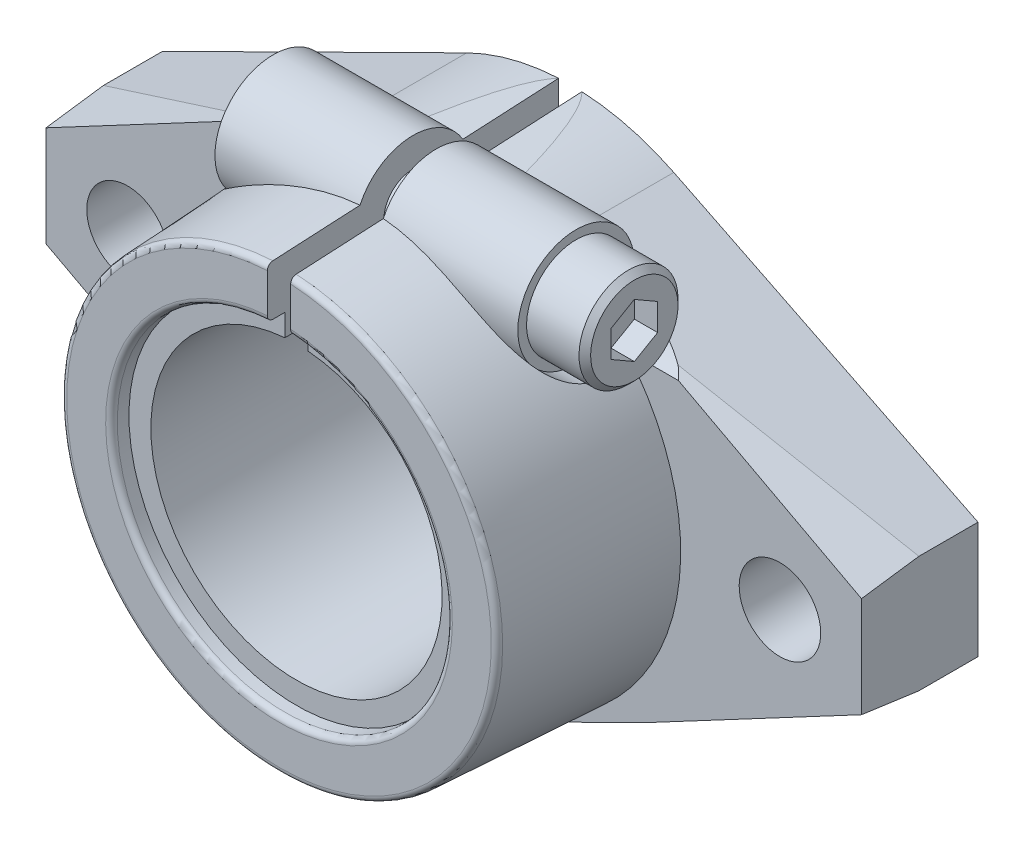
ISO-10303-21;
HEADER;
FILE_DESCRIPTION(('STEP AP214'),'2;1');
FILE_NAME('part.step','',(''),(''),'','','');
FILE_SCHEMA(('AUTOMOTIVE_DESIGN { 1 0 10303 214 1 1 1 1 }'));
ENDSEC;
DATA;
#1=APPLICATION_CONTEXT('core data for automotive mechanical design processes');
#2=APPLICATION_PROTOCOL_DEFINITION('international standard','automotive_design',2000,#1);
#3=PRODUCT_CONTEXT('',#1,'mechanical');
#4=PRODUCT('Part','Part','',(#3));
#5=PRODUCT_RELATED_PRODUCT_CATEGORY('part','',(#4));
#6=PRODUCT_DEFINITION_FORMATION('','',#4);
#7=PRODUCT_DEFINITION_CONTEXT('part definition',#1,'design');
#8=PRODUCT_DEFINITION('design','',#6,#7);
#9=PRODUCT_DEFINITION_SHAPE('','',#8);
#10=(LENGTH_UNIT() NAMED_UNIT(*) SI_UNIT(.MILLI.,.METRE.));
#11=(NAMED_UNIT(*) PLANE_ANGLE_UNIT() SI_UNIT($,.RADIAN.));
#12=(NAMED_UNIT(*) SI_UNIT($,.STERADIAN.) SOLID_ANGLE_UNIT());
#13=UNCERTAINTY_MEASURE_WITH_UNIT(LENGTH_MEASURE(1.E-05),#10,'distance_accuracy_value','');
#14=(GEOMETRIC_REPRESENTATION_CONTEXT(3) GLOBAL_UNCERTAINTY_ASSIGNED_CONTEXT((#13)) GLOBAL_UNIT_ASSIGNED_CONTEXT((#10,
#11,#12)) REPRESENTATION_CONTEXT('',''));
#15=CARTESIAN_POINT('',(0.,0.,0.));
#16=DIRECTION('',(0.,0.,1.));
#17=DIRECTION('',(1.,0.,0.));
#18=AXIS2_PLACEMENT_3D('',#15,#16,#17);
#19=CARTESIAN_POINT('',(-8.87395893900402,-17.9249749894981,0.));
#20=DIRECTION('',(-0.443420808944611,-0.896313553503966,0.));
#21=DIRECTION('',(-0.896313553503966,0.443420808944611,0.));
#22=AXIS2_PLACEMENT_3D('',#19,#20,#21);
#23=PLANE('',#22);
#24=DIRECTION('',(-0.87187219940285,0.431329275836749,-0.231935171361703));
#25=VECTOR('',#24,1.);
#26=CARTESIAN_POINT('',(-24.6055782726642,-10.1422885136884,7.83751070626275));
#27=LINE('',#26,#25);
#28=CARTESIAN_POINT('',(-16.4765209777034,-14.1638646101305,10.));
#29=VERTEX_POINT('',#28);
#30=CARTESIAN_POINT('',(-35.,-5.,5.07238987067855));
#31=VERTEX_POINT('',#30);
#32=EDGE_CURVE('E413',#29,#31,#27,.T.);
#33=ORIENTED_EDGE('',*,*,#32,.T.);
#34=DIRECTION('',(0.,0.,1.));
#35=VECTOR('',#34,1.);
#36=CARTESIAN_POINT('',(-35.,-5.,0.));
#37=LINE('',#36,#35);
#38=CARTESIAN_POINT('',(-35.,-5.,0.));
#39=VERTEX_POINT('',#38);
#40=EDGE_CURVE('E447',#39,#31,#37,.T.);
#41=ORIENTED_EDGE('',*,*,#40,.F.);
#42=DIRECTION('',(0.896313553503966,-0.443420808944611,0.));
#43=VECTOR('',#42,1.);
#44=CARTESIAN_POINT('',(-35.,-5.,0.));
#45=LINE('',#44,#43);
#46=CARTESIAN_POINT('',(-8.87395893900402,-17.9249749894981,0.));
#47=VERTEX_POINT('',#46);
#48=EDGE_CURVE('E867',#39,#47,#45,.T.);
#49=ORIENTED_EDGE('',*,*,#48,.T.);
#50=DIRECTION('',(0.,0.,1.));
#51=VECTOR('',#50,1.);
#52=CARTESIAN_POINT('',(-8.87395893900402,-17.9249749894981,0.));
#53=LINE('',#52,#51);
#54=CARTESIAN_POINT('',(-8.87395893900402,-17.9249749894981,10.));
#55=VERTEX_POINT('',#54);
#56=EDGE_CURVE('E431',#47,#55,#53,.T.);
#57=ORIENTED_EDGE('',*,*,#56,.T.);
#58=DIRECTION('',(-0.896313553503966,0.443420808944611,0.));
#59=VECTOR('',#58,1.);
#60=CARTESIAN_POINT('',(-35.,-5.,10.));
#61=LINE('',#60,#59);
#62=EDGE_CURVE('E444',#55,#29,#61,.T.);
#63=ORIENTED_EDGE('',*,*,#62,.T.);
#64=EDGE_LOOP('',(#33,#41,#49,#57,#63));
#65=FACE_BOUND('',#64,.T.);
#66=ADVANCED_FACE('F55',(#65),#23,.T.);
#67=CARTESIAN_POINT('',(0.,0.0125000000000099,0.));
#68=DIRECTION('',(0.,0.,-1.));
#69=DIRECTION('',(-0.44342080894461,-0.896313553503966,0.));
#70=AXIS2_PLACEMENT_3D('',#67,#68,#69);
#71=CYLINDRICAL_SURFACE('',#70,20.0125);
#72=CARTESIAN_POINT('',(0.,0.0125000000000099,384.855769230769));
#73=DIRECTION('',(0.,0.998650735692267,-0.0519298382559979));
#74=DIRECTION('',(0.,-0.0519298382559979,-0.998650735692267));
#75=AXIS2_PLACEMENT_3D('',#72,#73,#74);
#76=ELLIPSE('',#75,385.375742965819,20.0125);
#77=CARTESIAN_POINT('',(4.53239451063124,-19.48,10.));
#78=VERTEX_POINT('',#77);
#79=CARTESIAN_POINT('',(0.,-20.,0.));
#80=VERTEX_POINT('',#79);
#81=EDGE_CURVE('E829',#78,#80,#76,.T.);
#82=ORIENTED_EDGE('',*,*,#81,.T.);
#83=CARTESIAN_POINT('',(0.,0.0125000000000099,0.));
#84=DIRECTION('',(0.,0.,1.));
#85=DIRECTION('',(-0.443420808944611,-0.896313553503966,0.));
#86=AXIS2_PLACEMENT_3D('',#83,#84,#85);
#87=CIRCLE('',#86,20.0125);
#88=CARTESIAN_POINT('',(8.87395893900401,-17.9249749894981,0.));
#89=VERTEX_POINT('',#88);
#90=EDGE_CURVE('E900',#80,#89,#87,.T.);
#91=ORIENTED_EDGE('',*,*,#90,.T.);
#92=DIRECTION('',(0.,0.,1.));
#93=VECTOR('',#92,1.);
#94=CARTESIAN_POINT('',(8.87395893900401,-17.9249749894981,0.));
#95=LINE('',#94,#93);
#96=CARTESIAN_POINT('',(8.87395893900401,-17.9249749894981,10.));
#97=VERTEX_POINT('',#96);
#98=EDGE_CURVE('E455',#89,#97,#95,.T.);
#99=ORIENTED_EDGE('',*,*,#98,.T.);
#100=CARTESIAN_POINT('',(0.,0.0125000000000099,10.));
#101=DIRECTION('',(0.,0.,-1.));
#102=DIRECTION('',(-0.443420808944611,-0.896313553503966,0.));
#103=AXIS2_PLACEMENT_3D('',#100,#101,#102);
#104=CIRCLE('',#103,20.0125);
#105=EDGE_CURVE('E874',#97,#78,#104,.T.);
#106=ORIENTED_EDGE('',*,*,#105,.T.);
#107=EDGE_LOOP('',(#82,#91,#99,#106));
#108=FACE_BOUND('',#107,.T.);
#109=ADVANCED_FACE('F530',(#108),#71,.T.);
#110=CARTESIAN_POINT('',(35.,5.,0.));
#111=DIRECTION('',(1.,0.,0.));
#112=DIRECTION('',(0.,1.,0.));
#113=AXIS2_PLACEMENT_3D('',#110,#111,#112);
#114=PLANE('',#113);
#115=DIRECTION('',(0.,-0.137736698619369,-0.990468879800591));
#116=VECTOR('',#115,1.);
#117=CARTESIAN_POINT('',(35.,-5.54970979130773,1.11940967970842));
#118=LINE('',#117,#116);
#119=CARTESIAN_POINT('',(35.,-4.31475610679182,10.));
#120=VERTEX_POINT('',#119);
#121=CARTESIAN_POINT('',(35.,-5.,5.07238987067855));
#122=VERTEX_POINT('',#121);
#123=EDGE_CURVE('E451',#120,#122,#118,.T.);
#124=ORIENTED_EDGE('',*,*,#123,.T.);
#125=DIRECTION('',(0.,0.,1.));
#126=VECTOR('',#125,1.);
#127=CARTESIAN_POINT('',(35.,-5.,0.));
#128=LINE('',#127,#126);
#129=CARTESIAN_POINT('',(35.,-5.,0.));
#130=VERTEX_POINT('',#129);
#131=EDGE_CURVE('E746',#130,#122,#128,.T.);
#132=ORIENTED_EDGE('',*,*,#131,.F.);
#133=DIRECTION('',(0.,1.,0.));
#134=VECTOR('',#133,1.);
#135=CARTESIAN_POINT('',(35.,-5.,0.));
#136=LINE('',#135,#134);
#137=CARTESIAN_POINT('',(35.,5.,0.));
#138=VERTEX_POINT('',#137);
#139=EDGE_CURVE('E886',#130,#138,#136,.T.);
#140=ORIENTED_EDGE('',*,*,#139,.T.);
#141=DIRECTION('',(0.,0.,1.));
#142=VECTOR('',#141,1.);
#143=CARTESIAN_POINT('',(35.,5.,0.));
#144=LINE('',#143,#142);
#145=CARTESIAN_POINT('',(35.,5.,5.07238987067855));
#146=VERTEX_POINT('',#145);
#147=EDGE_CURVE('E890',#138,#146,#144,.T.);
#148=ORIENTED_EDGE('',*,*,#147,.T.);
#149=DIRECTION('',(0.,-0.137736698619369,0.990468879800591));
#150=VECTOR('',#149,1.);
#151=CARTESIAN_POINT('',(35.,5.64456678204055,0.437290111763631));
#152=LINE('',#151,#150);
#153=CARTESIAN_POINT('',(35.,4.31475610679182,10.));
#154=VERTEX_POINT('',#153);
#155=EDGE_CURVE('E716',#146,#154,#152,.T.);
#156=ORIENTED_EDGE('',*,*,#155,.T.);
#157=DIRECTION('',(0.,-1.,0.));
#158=VECTOR('',#157,1.);
#159=CARTESIAN_POINT('',(35.,-5.,10.));
#160=LINE('',#159,#158);
#161=EDGE_CURVE('E710',#154,#120,#160,.T.);
#162=ORIENTED_EDGE('',*,*,#161,.T.);
#163=EDGE_LOOP('',(#124,#132,#140,#148,#156,#162));
#164=FACE_BOUND('',#163,.T.);
#165=ADVANCED_FACE('F527',(#164),#114,.T.);
#166=CARTESIAN_POINT('',(0.,0.0125000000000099,0.));
#167=DIRECTION('',(0.,0.,-1.));
#168=DIRECTION('',(0.444109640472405,0.895972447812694,0.));
#169=AXIS2_PLACEMENT_3D('',#166,#167,#168);
#170=CYLINDRICAL_SURFACE('',#169,20.0125);
#171=CARTESIAN_POINT('',(-8.88774417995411,17.9431486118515,7.58975859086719));
#172=CARTESIAN_POINT('',(-8.80135225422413,17.9859708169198,7.5979880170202));
#173=CARTESIAN_POINT('',(-8.71468692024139,18.0281507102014,7.60667887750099));
#174=CARTESIAN_POINT('',(-8.53709995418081,18.1130020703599,7.62527817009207));
#175=CARTESIAN_POINT('',(-8.44615513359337,18.1556170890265,7.63522282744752));
#176=CARTESIAN_POINT('',(-8.25995270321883,18.2411659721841,7.65632920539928));
#177=CARTESIAN_POINT('',(-8.16467171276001,18.2840407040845,7.66752418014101));
#178=CARTESIAN_POINT('',(-7.96974144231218,18.3699280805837,7.69112993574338));
#179=CARTESIAN_POINT('',(-7.87006862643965,18.4128789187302,7.70357131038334));
#180=CARTESIAN_POINT('',(-7.685245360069,18.4907476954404,7.72726484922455));
#181=CARTESIAN_POINT('',(-7.60017914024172,18.5258978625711,7.7384121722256));
#182=CARTESIAN_POINT('',(-7.42278426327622,18.597771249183,7.76204837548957));
#183=CARTESIAN_POINT('',(-7.33041996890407,18.6343947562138,7.77457317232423));
#184=CARTESIAN_POINT('',(-7.13833474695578,18.7089092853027,7.80099572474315));
#185=CARTESIAN_POINT('',(-7.03857661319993,18.7466926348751,7.81492638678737));
#186=CARTESIAN_POINT('',(-6.83158931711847,18.8232028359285,7.84404187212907));
#187=CARTESIAN_POINT('',(-6.72432028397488,18.8618144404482,7.8592468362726));
#188=CARTESIAN_POINT('',(-6.58152425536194,18.9118410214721,7.87994342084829));
#189=CARTESIAN_POINT('',(-6.54623913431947,18.924091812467,7.88509438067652));
#190=CARTESIAN_POINT('',(-6.43398783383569,18.9627130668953,7.90148265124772));
#191=CARTESIAN_POINT('',(-6.3568965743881,18.988712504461,7.91274023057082));
#192=CARTESIAN_POINT('',(-6.16061967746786,19.0535776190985,7.94135001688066));
#193=CARTESIAN_POINT('',(-6.04122026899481,19.0917958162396,7.95870510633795));
#194=CARTESIAN_POINT('',(-5.75969383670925,19.1790011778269,7.99955606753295));
#195=CARTESIAN_POINT('',(-5.59728039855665,19.2270593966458,8.02306906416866));
#196=CARTESIAN_POINT('',(-5.31920812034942,19.3055162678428,8.06302939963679));
#197=CARTESIAN_POINT('',(-5.20384676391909,19.3369517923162,8.07952098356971));
#198=CARTESIAN_POINT('',(-4.98295068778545,19.3950230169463,8.11071576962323));
#199=CARTESIAN_POINT('',(-4.87746648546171,19.4218360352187,8.12544629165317));
#200=CARTESIAN_POINT('',(-4.67649605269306,19.4711783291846,8.15316324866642));
#201=CARTESIAN_POINT('',(-4.5810533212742,19.4938689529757,8.16617803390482));
#202=CARTESIAN_POINT('',(-4.40029877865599,19.5354392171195,8.19043488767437));
#203=CARTESIAN_POINT('',(-4.31502532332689,19.5544637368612,8.20171468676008));
#204=CARTESIAN_POINT('',(-4.22960750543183,19.5729339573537,8.21280851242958));
#205=B_SPLINE_CURVE_WITH_KNOTS('',3,(#171,#172,#173,#174,#175,#176,#177,#178,#179,#180,#181,
#182,#183,#184,#185,#186,#187,#188,#189,#190,#191,#192,#193,#194,#195,#196,#197,#198,#199,#200,
#201,#202,#203,#204),.UNSPECIFIED.,.F.,.F.,(4,2,2,2,2,2,2,2,2,2,2,2,2,2,2,2,4),(0.,
0.290314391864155,0.593074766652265,0.908302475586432,1.23601642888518,1.51415175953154,
1.81457875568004,2.13730365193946,2.48233145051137,2.59544558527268,2.84183711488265,
3.22150344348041,3.73444052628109,4.09652185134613,4.42599972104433,4.72287600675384,
4.98715337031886),.UNSPECIFIED.);
#206=CARTESIAN_POINT('',(-8.88774417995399,17.9431486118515,7.58975859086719));
#207=VERTEX_POINT('',#206);
#208=CARTESIAN_POINT('',(-4.2296075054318,19.5729339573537,8.21280851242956));
#209=VERTEX_POINT('',#208);
#210=EDGE_CURVE('E658',#207,#209,#205,.T.);
#211=ORIENTED_EDGE('',*,*,#210,.T.);
#212=CARTESIAN_POINT('',(0.,0.0125000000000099,384.375));
#213=DIRECTION('',(0.,-0.998650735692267,-0.0519298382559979));
#214=DIRECTION('',(0.,0.0519298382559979,-0.998650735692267));
#215=AXIS2_PLACEMENT_3D('',#212,#213,#214);
#216=ELLIPSE('',#215,385.375742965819,20.0125);
#217=CARTESIAN_POINT('',(-0.99999999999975,20.,0.));
#218=VERTEX_POINT('',#217);
#219=EDGE_CURVE('E720',#209,#218,#216,.T.);
#220=ORIENTED_EDGE('',*,*,#219,.T.);
#221=CARTESIAN_POINT('',(0.,0.0125000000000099,0.));
#222=DIRECTION('',(0.,0.,1.));
#223=DIRECTION('',(0.444109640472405,0.895972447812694,0.));
#224=AXIS2_PLACEMENT_3D('',#221,#222,#223);
#225=CIRCLE('',#224,20.0125);
#226=CARTESIAN_POINT('',(-8.88774417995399,17.9431486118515,0.));
#227=VERTEX_POINT('',#226);
#228=EDGE_CURVE('E1789',#218,#227,#225,.T.);
#229=ORIENTED_EDGE('',*,*,#228,.T.);
#230=DIRECTION('',(0.,0.,1.));
#231=VECTOR('',#230,1.);
#232=CARTESIAN_POINT('',(-8.88774417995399,17.9431486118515,0.));
#233=LINE('',#232,#231);
#234=EDGE_CURVE('E606',#227,#207,#233,.T.);
#235=ORIENTED_EDGE('',*,*,#234,.T.);
#236=EDGE_LOOP('',(#211,#220,#229,#235));
#237=FACE_BOUND('',#236,.T.);
#238=ADVANCED_FACE('F525',(#237),#170,.T.);
#239=CARTESIAN_POINT('',(-35.,5.,0.));
#240=DIRECTION('',(-0.444109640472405,0.895972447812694,0.));
#241=DIRECTION('',(0.,0.,1.));
#242=AXIS2_PLACEMENT_3D('',#239,#240,#241);
#243=PLANE('',#242);
#244=CARTESIAN_POINT('',(-10.790506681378,17.,12.5));
#245=DIRECTION('',(0.444109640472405,-0.895972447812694,0.));
#246=DIRECTION('',(0.895972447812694,0.444109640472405,0.));
#247=AXIS2_PLACEMENT_3D('',#244,#245,#246);
#248=ELLIPSE('',#247,11.2584811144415,5.);
#249=CARTESIAN_POINT('',(-18.5849417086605,13.136506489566,9.32613518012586));
#250=VERTEX_POINT('',#249);
#251=CARTESIAN_POINT('',(-13.,15.904813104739,7.6214176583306));
#252=VERTEX_POINT('',#251);
#253=EDGE_CURVE('E2113',#250,#252,#248,.T.);
#254=ORIENTED_EDGE('',*,*,#253,.T.);
#255=CARTESIAN_POINT('',(-10.790506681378,17.,12.5));
#256=DIRECTION('',(0.444109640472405,-0.895972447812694,0.));
#257=DIRECTION('',(0.895972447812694,0.444109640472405,0.));
#258=AXIS2_PLACEMENT_3D('',#255,#256,#257);
#259=ELLIPSE('',#258,11.2584811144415,5.);
#260=EDGE_CURVE('E2016',#252,#207,#259,.T.);
#261=ORIENTED_EDGE('',*,*,#260,.T.);
#262=ORIENTED_EDGE('',*,*,#234,.F.);
#263=DIRECTION('',(-0.895972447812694,-0.444109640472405,0.));
#264=VECTOR('',#263,1.);
#265=CARTESIAN_POINT('',(-8.88774417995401,17.9431486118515,0.));
#266=LINE('',#265,#264);
#267=CARTESIAN_POINT('',(-35.,5.,0.));
#268=VERTEX_POINT('',#267);
#269=EDGE_CURVE('E866',#227,#268,#266,.T.);
#270=ORIENTED_EDGE('',*,*,#269,.T.);
#271=DIRECTION('',(0.,0.,1.));
#272=VECTOR('',#271,1.);
#273=CARTESIAN_POINT('',(-35.,5.,0.));
#274=LINE('',#273,#272);
#275=CARTESIAN_POINT('',(-35.,5.,5.07238987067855));
#276=VERTEX_POINT('',#275);
#277=EDGE_CURVE('E412',#268,#276,#274,.T.);
#278=ORIENTED_EDGE('',*,*,#277,.T.);
#279=DIRECTION('',(0.872757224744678,0.432602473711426,0.226163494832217));
#280=VECTOR('',#279,1.);
#281=CARTESIAN_POINT('',(-36.9451101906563,4.03586076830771,4.56834028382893));
#282=LINE('',#281,#280);
#283=EDGE_CURVE('E408',#276,#250,#282,.T.);
#284=ORIENTED_EDGE('',*,*,#283,.T.);
#285=EDGE_LOOP('',(#254,#261,#262,#270,#278,#284));
#286=FACE_BOUND('',#285,.T.);
#287=ADVANCED_FACE('F522',(#286),#243,.T.);
#288=CARTESIAN_POINT('',(-37.3298609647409,4.38183117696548,0.609346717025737));
#289=DIRECTION('',(-0.465972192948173,0.876366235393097,0.121869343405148));
#290=DIRECTION('',(0.253027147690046,0.,0.967459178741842));
#291=AXIS2_PLACEMENT_3D('',#288,#289,#290);
#292=PLANE('',#291);
#293=CARTESIAN_POINT('',(-10.4886815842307,17.,12.5));
#294=DIRECTION('',(0.465972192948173,-0.876366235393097,-0.121869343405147));
#295=DIRECTION('',(0.884799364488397,0.461530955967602,0.064181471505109));
#296=AXIS2_PLACEMENT_3D('',#293,#294,#295);
#297=ELLIPSE('',#296,10.7302540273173,5.);
#298=CARTESIAN_POINT('',(-19.2863105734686,12.6698729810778,10.));
#299=VERTEX_POINT('',#298);
#300=EDGE_CURVE('E2106',#299,#250,#297,.T.);
#301=ORIENTED_EDGE('',*,*,#300,.T.);
#302=ORIENTED_EDGE('',*,*,#283,.F.);
#303=DIRECTION('',(0.,0.137736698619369,-0.990468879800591));
#304=VECTOR('',#303,1.);
#305=CARTESIAN_POINT('',(-35.,5.54970979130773,1.11940967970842));
#306=LINE('',#305,#304);
#307=CARTESIAN_POINT('',(-35.,4.31475610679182,10.));
#308=VERTEX_POINT('',#307);
#309=EDGE_CURVE('E401',#308,#276,#306,.T.);
#310=ORIENTED_EDGE('',*,*,#309,.F.);
#311=DIRECTION('',(-0.882947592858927,-0.469471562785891,0.));
#312=VECTOR('',#311,1.);
#313=CARTESIAN_POINT('',(-23.1456095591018,10.6178473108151,10.));
#314=LINE('',#313,#312);
#315=EDGE_CURVE('E406',#299,#308,#314,.T.);
#316=ORIENTED_EDGE('',*,*,#315,.F.);
#317=EDGE_LOOP('',(#301,#302,#310,#316));
#318=FACE_BOUND('',#317,.T.);
#319=ADVANCED_FACE('F404',(#318),#292,.T.);
#320=CARTESIAN_POINT('',(35.,-5.,0.));
#321=DIRECTION('',(0.443420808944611,-0.896313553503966,0.));
#322=DIRECTION('',(0.,0.,-1.));
#323=AXIS2_PLACEMENT_3D('',#320,#321,#322);
#324=PLANE('',#323);
#325=DIRECTION('',(-0.87187219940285,-0.431329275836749,0.231935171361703));
#326=VECTOR('',#325,1.);
#327=CARTESIAN_POINT('',(36.9658876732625,-4.02744357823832,4.54942504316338));
#328=LINE('',#327,#326);
#329=CARTESIAN_POINT('',(16.4765209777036,-14.1638646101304,10.));
#330=VERTEX_POINT('',#329);
#331=EDGE_CURVE('E448',#122,#330,#328,.T.);
#332=ORIENTED_EDGE('',*,*,#331,.T.);
#333=DIRECTION('',(-0.896313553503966,-0.443420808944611,0.));
#334=VECTOR('',#333,1.);
#335=CARTESIAN_POINT('',(8.87395893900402,-17.9249749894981,10.));
#336=LINE('',#335,#334);
#337=EDGE_CURVE('E870',#330,#97,#336,.T.);
#338=ORIENTED_EDGE('',*,*,#337,.T.);
#339=ORIENTED_EDGE('',*,*,#98,.F.);
#340=DIRECTION('',(0.896313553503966,0.443420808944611,0.));
#341=VECTOR('',#340,1.);
#342=CARTESIAN_POINT('',(8.87395893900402,-17.9249749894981,0.));
#343=LINE('',#342,#341);
#344=EDGE_CURVE('E894',#89,#130,#343,.T.);
#345=ORIENTED_EDGE('',*,*,#344,.T.);
#346=ORIENTED_EDGE('',*,*,#131,.T.);
#347=EDGE_LOOP('',(#332,#338,#339,#345,#346));
#348=FACE_BOUND('',#347,.T.);
#349=ADVANCED_FACE('F518',(#348),#324,.T.);
#350=CARTESIAN_POINT('',(37.3298609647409,-4.38183117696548,0.609346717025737));
#351=DIRECTION('',(-0.465972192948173,0.876366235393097,-0.121869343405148));
#352=DIRECTION('',(-0.253027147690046,0.,0.967459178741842));
#353=AXIS2_PLACEMENT_3D('',#350,#351,#352);
#354=PLANE('',#353);
#355=DIRECTION('',(0.882947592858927,0.469471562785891,0.));
#356=VECTOR('',#355,1.);
#357=CARTESIAN_POINT('',(23.1456095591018,-10.6178473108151,10.));
#358=LINE('',#357,#356);
#359=EDGE_CURVE('E715',#330,#120,#358,.T.);
#360=ORIENTED_EDGE('',*,*,#359,.F.);
#361=ORIENTED_EDGE('',*,*,#331,.F.);
#362=ORIENTED_EDGE('',*,*,#123,.F.);
#363=EDGE_LOOP('',(#360,#361,#362));
#364=FACE_BOUND('',#363,.T.);
#365=ADVANCED_FACE('F515',(#364),#354,.F.);
#366=CARTESIAN_POINT('',(-35.,-5.,0.));
#367=DIRECTION('',(-1.,0.,0.));
#368=DIRECTION('',(0.,0.,1.));
#369=AXIS2_PLACEMENT_3D('',#366,#367,#368);
#370=PLANE('',#369);
#371=DIRECTION('',(0.,0.137736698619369,0.990468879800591));
#372=VECTOR('',#371,1.);
#373=CARTESIAN_POINT('',(-35.,-5.64456678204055,0.437290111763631));
#374=LINE('',#373,#372);
#375=CARTESIAN_POINT('',(-35.,-4.31475610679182,10.));
#376=VERTEX_POINT('',#375);
#377=EDGE_CURVE('E419',#31,#376,#374,.T.);
#378=ORIENTED_EDGE('',*,*,#377,.T.);
#379=DIRECTION('',(0.,1.,0.));
#380=VECTOR('',#379,1.);
#381=CARTESIAN_POINT('',(-35.,5.,10.));
#382=LINE('',#381,#380);
#383=EDGE_CURVE('E416',#376,#308,#382,.T.);
#384=ORIENTED_EDGE('',*,*,#383,.T.);
#385=ORIENTED_EDGE('',*,*,#309,.T.);
#386=ORIENTED_EDGE('',*,*,#277,.F.);
#387=DIRECTION('',(0.,-1.,0.));
#388=VECTOR('',#387,1.);
#389=CARTESIAN_POINT('',(-35.,5.,0.));
#390=LINE('',#389,#388);
#391=EDGE_CURVE('E862',#268,#39,#390,.T.);
#392=ORIENTED_EDGE('',*,*,#391,.T.);
#393=ORIENTED_EDGE('',*,*,#40,.T.);
#394=EDGE_LOOP('',(#378,#384,#385,#386,#392,#393));
#395=FACE_BOUND('',#394,.T.);
#396=ADVANCED_FACE('F417',(#395),#370,.T.);
#397=CARTESIAN_POINT('',(-37.3298609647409,-4.38183117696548,0.609346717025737));
#398=DIRECTION('',(-0.465972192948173,-0.876366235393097,0.121869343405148));
#399=DIRECTION('',(-0.882947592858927,0.469471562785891,0.));
#400=AXIS2_PLACEMENT_3D('',#397,#398,#399);
#401=PLANE('',#400);
#402=DIRECTION('',(0.882947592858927,-0.469471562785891,0.));
#403=VECTOR('',#402,1.);
#404=CARTESIAN_POINT('',(-23.1456095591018,-10.6178473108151,10.));
#405=LINE('',#404,#403);
#406=EDGE_CURVE('E424',#376,#29,#405,.T.);
#407=ORIENTED_EDGE('',*,*,#406,.F.);
#408=ORIENTED_EDGE('',*,*,#377,.F.);
#409=ORIENTED_EDGE('',*,*,#32,.F.);
#410=EDGE_LOOP('',(#407,#408,#409));
#411=FACE_BOUND('',#410,.T.);
#412=ADVANCED_FACE('F508',(#411),#401,.T.);
#413=CARTESIAN_POINT('',(0.,9.35,25.));
#414=DIRECTION('',(0.,0.,1.));
#415=DIRECTION('',(1.,0.,0.));
#416=AXIS2_PLACEMENT_3D('',#413,#414,#415);
#417=PLANE('',#416);
#418=DIRECTION('',(0.,-1.,0.));
#419=VECTOR('',#418,1.);
#420=CARTESIAN_POINT('',(1.,17.175,25.));
#421=LINE('',#420,#419);
#422=CARTESIAN_POINT('',(1.,18.1978694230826,25.));
#423=VERTEX_POINT('',#422);
#424=CARTESIAN_POINT('',(1.,14.8463598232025,25.));
#425=VERTEX_POINT('',#424);
#426=EDGE_CURVE('E924',#423,#425,#421,.T.);
#427=ORIENTED_EDGE('',*,*,#426,.T.);
#428=CARTESIAN_POINT('',(0.,0.,25.));
#429=DIRECTION('',(0.,0.,1.));
#430=DIRECTION('',(1.,0.,0.));
#431=AXIS2_PLACEMENT_3D('',#428,#429,#430);
#432=CIRCLE('',#431,14.88);
#433=CARTESIAN_POINT('',(-1.,14.8463598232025,25.));
#434=VERTEX_POINT('',#433);
#435=EDGE_CURVE('E2165',#425,#434,#432,.F.);
#436=ORIENTED_EDGE('',*,*,#435,.T.);
#437=DIRECTION('',(0.,1.,0.));
#438=VECTOR('',#437,1.);
#439=CARTESIAN_POINT('',(-1.,4.675,25.));
#440=LINE('',#439,#438);
#441=CARTESIAN_POINT('',(-1.,18.1978694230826,25.));
#442=VERTEX_POINT('',#441);
#443=EDGE_CURVE('E878',#434,#442,#440,.T.);
#444=ORIENTED_EDGE('',*,*,#443,.T.);
#445=CARTESIAN_POINT('',(0.,0.,25.));
#446=DIRECTION('',(0.,0.,1.));
#447=DIRECTION('',(1.,0.,0.));
#448=AXIS2_PLACEMENT_3D('',#445,#446,#447);
#449=CIRCLE('',#448,18.2253244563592);
#450=EDGE_CURVE('E559',#442,#423,#449,.T.);
#451=ORIENTED_EDGE('',*,*,#450,.T.);
#452=EDGE_LOOP('',(#427,#436,#444,#451));
#453=FACE_BOUND('',#452,.T.);
#454=ADVANCED_FACE('F505',(#453),#417,.T.);
#455=CARTESIAN_POINT('',(0.,0.,10.));
#456=DIRECTION('',(0.,0.,1.));
#457=DIRECTION('',(1.,0.,0.));
#458=AXIS2_PLACEMENT_3D('',#455,#456,#457);
#459=PLANE('',#458);
#460=CARTESIAN_POINT('',(-28.,0.,10.));
#461=DIRECTION('',(0.,0.,-1.));
#462=DIRECTION('',(0.,1.,0.));
#463=AXIS2_PLACEMENT_3D('',#460,#461,#462);
#464=CIRCLE('',#463,3.5);
#465=CARTESIAN_POINT('',(-28.,-3.5,10.));
#466=VERTEX_POINT('',#465);
#467=EDGE_CURVE('E782',#466,#466,#464,.T.);
#468=ORIENTED_EDGE('',*,*,#467,.T.);
#469=EDGE_LOOP('',(#468));
#470=FACE_BOUND('',#469,.T.);
#471=DIRECTION('',(-1.,0.,0.));
#472=VECTOR('',#471,1.);
#473=CARTESIAN_POINT('',(-12.5,12.6698729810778,10.));
#474=LINE('',#473,#472);
#475=CARTESIAN_POINT('',(-14.7967806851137,12.6698729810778,10.));
#476=VERTEX_POINT('',#475);
#477=EDGE_CURVE('E428',#476,#299,#474,.T.);
#478=ORIENTED_EDGE('',*,*,#477,.T.);
#479=ORIENTED_EDGE('',*,*,#315,.T.);
#480=ORIENTED_EDGE('',*,*,#383,.F.);
#481=ORIENTED_EDGE('',*,*,#406,.T.);
#482=ORIENTED_EDGE('',*,*,#62,.F.);
#483=CARTESIAN_POINT('',(0.,0.0125000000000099,10.));
#484=DIRECTION('',(0.,0.,-1.));
#485=DIRECTION('',(-0.443420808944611,-0.896313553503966,0.));
#486=AXIS2_PLACEMENT_3D('',#483,#484,#485);
#487=CIRCLE('',#486,20.0125);
#488=CARTESIAN_POINT('',(-4.53239451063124,-19.48,10.));
#489=VERTEX_POINT('',#488);
#490=EDGE_CURVE('E436',#489,#55,#487,.T.);
#491=ORIENTED_EDGE('',*,*,#490,.F.);
#492=DIRECTION('',(1.,0.,0.));
#493=VECTOR('',#492,1.);
#494=CARTESIAN_POINT('',(4.,-19.48,10.));
#495=LINE('',#494,#493);
#496=CARTESIAN_POINT('',(0.,-19.48,10.));
#497=VERTEX_POINT('',#496);
#498=EDGE_CURVE('E439',#489,#497,#495,.T.);
#499=ORIENTED_EDGE('',*,*,#498,.T.);
#500=CARTESIAN_POINT('',(0.,0.,10.));
#501=DIRECTION('',(0.,0.,-1.));
#502=DIRECTION('',(0.,1.,0.));
#503=AXIS2_PLACEMENT_3D('',#500,#501,#502);
#504=CIRCLE('',#503,19.48);
#505=EDGE_CURVE('E968',#497,#476,#504,.T.);
#506=ORIENTED_EDGE('',*,*,#505,.T.);
#507=EDGE_LOOP('',(#478,#479,#480,#481,#482,#491,#499,#506));
#508=FACE_BOUND('',#507,.T.);
#509=ADVANCED_FACE('F426',(#470,#508),#459,.T.);
#510=CARTESIAN_POINT('',(0.,0.0125000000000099,0.));
#511=DIRECTION('',(0.,0.,-1.));
#512=DIRECTION('',(-0.44342080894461,-0.896313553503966,0.));
#513=AXIS2_PLACEMENT_3D('',#510,#511,#512);
#514=CYLINDRICAL_SURFACE('',#513,20.0125);
#515=CARTESIAN_POINT('',(0.,0.0125000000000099,384.855769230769));
#516=DIRECTION('',(0.,0.998650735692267,-0.0519298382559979));
#517=DIRECTION('',(0.,-0.0519298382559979,-0.998650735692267));
#518=AXIS2_PLACEMENT_3D('',#515,#516,#517);
#519=ELLIPSE('',#518,385.375742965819,20.0125);
#520=EDGE_CURVE('E714',#80,#489,#519,.T.);
#521=ORIENTED_EDGE('',*,*,#520,.T.);
#522=ORIENTED_EDGE('',*,*,#490,.T.);
#523=ORIENTED_EDGE('',*,*,#56,.F.);
#524=CARTESIAN_POINT('',(0.,0.0125000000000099,0.));
#525=DIRECTION('',(0.,0.,1.));
#526=DIRECTION('',(-0.443420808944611,-0.896313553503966,0.));
#527=AXIS2_PLACEMENT_3D('',#524,#525,#526);
#528=CIRCLE('',#527,20.0125);
#529=EDGE_CURVE('E904',#47,#80,#528,.T.);
#530=ORIENTED_EDGE('',*,*,#529,.T.);
#531=EDGE_LOOP('',(#521,#522,#523,#530));
#532=FACE_BOUND('',#531,.T.);
#533=ADVANCED_FACE('F501',(#532),#514,.T.);
#534=CARTESIAN_POINT('',(8.,-20.,0.));
#535=DIRECTION('',(0.,0.998650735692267,-0.0519298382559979));
#536=DIRECTION('',(-1.,0.,0.));
#537=AXIS2_PLACEMENT_3D('',#534,#535,#536);
#538=PLANE('',#537);
#539=ORIENTED_EDGE('',*,*,#520,.F.);
#540=ORIENTED_EDGE('',*,*,#81,.F.);
#541=DIRECTION('',(1.,0.,0.));
#542=VECTOR('',#541,1.);
#543=CARTESIAN_POINT('',(4.,-19.48,10.));
#544=LINE('',#543,#542);
#545=EDGE_CURVE('E923',#497,#78,#544,.T.);
#546=ORIENTED_EDGE('',*,*,#545,.F.);
#547=ORIENTED_EDGE('',*,*,#498,.F.);
#548=EDGE_LOOP('',(#539,#540,#546,#547));
#549=FACE_BOUND('',#548,.T.);
#550=ADVANCED_FACE('F499',(#549),#538,.F.);
#551=CARTESIAN_POINT('',(0.,0.,10.));
#552=DIRECTION('',(0.,0.,1.));
#553=DIRECTION('',(1.,0.,0.));
#554=AXIS2_PLACEMENT_3D('',#551,#552,#553);
#555=PLANE('',#554);
#556=CARTESIAN_POINT('',(28.,0.,10.));
#557=DIRECTION('',(0.,0.,-1.));
#558=DIRECTION('',(0.,1.,0.));
#559=AXIS2_PLACEMENT_3D('',#556,#557,#558);
#560=CIRCLE('',#559,3.5);
#561=CARTESIAN_POINT('',(28.,-3.5,10.));
#562=VERTEX_POINT('',#561);
#563=EDGE_CURVE('E793',#562,#562,#560,.T.);
#564=ORIENTED_EDGE('',*,*,#563,.T.);
#565=EDGE_LOOP('',(#564));
#566=FACE_BOUND('',#565,.T.);
#567=DIRECTION('',(-1.,0.,0.));
#568=VECTOR('',#567,1.);
#569=CARTESIAN_POINT('',(12.5,12.6698729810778,10.));
#570=LINE('',#569,#568);
#571=CARTESIAN_POINT('',(19.2863105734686,12.6698729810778,10.));
#572=VERTEX_POINT('',#571);
#573=CARTESIAN_POINT('',(14.7967806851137,12.6698729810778,10.));
#574=VERTEX_POINT('',#573);
#575=EDGE_CURVE('E941',#572,#574,#570,.T.);
#576=ORIENTED_EDGE('',*,*,#575,.T.);
#577=CARTESIAN_POINT('',(0.,0.,10.));
#578=DIRECTION('',(0.,0.,-1.));
#579=DIRECTION('',(0.,1.,0.));
#580=AXIS2_PLACEMENT_3D('',#577,#578,#579);
#581=CIRCLE('',#580,19.48);
#582=EDGE_CURVE('E945',#574,#497,#581,.T.);
#583=ORIENTED_EDGE('',*,*,#582,.T.);
#584=ORIENTED_EDGE('',*,*,#545,.T.);
#585=ORIENTED_EDGE('',*,*,#105,.F.);
#586=ORIENTED_EDGE('',*,*,#337,.F.);
#587=ORIENTED_EDGE('',*,*,#359,.T.);
#588=ORIENTED_EDGE('',*,*,#161,.F.);
#589=DIRECTION('',(-0.882947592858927,0.469471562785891,0.));
#590=VECTOR('',#589,1.);
#591=CARTESIAN_POINT('',(23.1456095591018,10.6178473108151,10.));
#592=LINE('',#591,#590);
#593=EDGE_CURVE('E721',#154,#572,#592,.T.);
#594=ORIENTED_EDGE('',*,*,#593,.T.);
#595=EDGE_LOOP('',(#576,#583,#584,#585,#586,#587,#588,#594));
#596=FACE_BOUND('',#595,.T.);
#597=ADVANCED_FACE('F495',(#566,#596),#555,.T.);
#598=CARTESIAN_POINT('',(8.,18.7,25.));
#599=DIRECTION('',(0.,-0.998650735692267,-0.0519298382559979));
#600=DIRECTION('',(0.,0.0519298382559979,-0.998650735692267));
#601=AXIS2_PLACEMENT_3D('',#598,#599,#600);
#602=PLANE('',#601);
#603=DIRECTION('',(1.,0.,0.));
#604=VECTOR('',#603,1.);
#605=CARTESIAN_POINT('',(2.81929946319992,19.5729339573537,8.21280851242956));
#606=LINE('',#605,#604);
#607=CARTESIAN_POINT('',(1.,19.5729339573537,8.21280851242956));
#608=VERTEX_POINT('',#607);
#609=CARTESIAN_POINT('',(4.22960750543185,19.5729339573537,8.21280851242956));
#610=VERTEX_POINT('',#609);
#611=EDGE_CURVE('E1031',#608,#610,#606,.T.);
#612=ORIENTED_EDGE('',*,*,#611,.T.);
#613=CARTESIAN_POINT('',(0.,0.0125000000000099,384.375));
#614=DIRECTION('',(0.,-0.998650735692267,-0.0519298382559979));
#615=DIRECTION('',(0.,0.0519298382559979,-0.998650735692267));
#616=AXIS2_PLACEMENT_3D('',#613,#614,#615);
#617=ELLIPSE('',#616,385.375742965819,20.0125);
#618=CARTESIAN_POINT('',(0.999999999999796,20.,0.));
#619=VERTEX_POINT('',#618);
#620=EDGE_CURVE('E914',#619,#610,#617,.T.);
#621=ORIENTED_EDGE('',*,*,#620,.F.);
#622=DIRECTION('',(0.,-0.0519298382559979,0.998650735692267));
#623=VECTOR('',#622,1.);
#624=CARTESIAN_POINT('',(1.,19.3567417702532,12.3703505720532));
#625=LINE('',#624,#623);
#626=EDGE_CURVE('E920',#619,#608,#625,.T.);
#627=ORIENTED_EDGE('',*,*,#626,.T.);
#628=EDGE_LOOP('',(#612,#621,#627));
#629=FACE_BOUND('',#628,.T.);
#630=ADVANCED_FACE('F492',(#629),#602,.F.);
#631=CARTESIAN_POINT('',(1.,25.,0.));
#632=DIRECTION('',(1.,0.,0.));
#633=DIRECTION('',(0.,1.,0.));
#634=AXIS2_PLACEMENT_3D('',#631,#632,#633);
#635=PLANE('',#634);
#636=CARTESIAN_POINT('',(1.,17.,12.5));
#637=DIRECTION('',(-1.,0.,0.));
#638=DIRECTION('',(0.,1.,0.));
#639=AXIS2_PLACEMENT_3D('',#636,#637,#638);
#640=CIRCLE('',#639,2.5);
#641=CARTESIAN_POINT('',(1.,14.5,12.5));
#642=VERTEX_POINT('',#641);
#643=EDGE_CURVE('E1036',#642,#642,#640,.T.);
#644=ORIENTED_EDGE('',*,*,#643,.F.);
#645=EDGE_LOOP('',(#644));
#646=FACE_BOUND('',#645,.T.);
#647=DIRECTION('',(0.,1.,0.));
#648=VECTOR('',#647,1.);
#649=CARTESIAN_POINT('',(1.,12.5,0.));
#650=LINE('',#649,#648);
#651=CARTESIAN_POINT('',(1.,12.9614813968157,0.));
#652=VERTEX_POINT('',#651);
#653=EDGE_CURVE('E881',#652,#619,#650,.T.);
#654=ORIENTED_EDGE('',*,*,#653,.F.);
#655=CARTESIAN_POINT('',(1.,12.9614813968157,0.));
#656=CARTESIAN_POINT('',(1.,12.9332034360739,-2.358609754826E-05));
#657=CARTESIAN_POINT('',(1.,12.9049322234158,0.00238333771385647));
#658=CARTESIAN_POINT('',(1.,12.8492080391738,0.0118840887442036));
#659=CARTESIAN_POINT('',(1.,12.8217545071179,0.018974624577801));
#660=CARTESIAN_POINT('',(1.,12.768415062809,0.0376736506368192));
#661=CARTESIAN_POINT('',(1.,12.7425299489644,0.049284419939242));
#662=CARTESIAN_POINT('',(1.,12.6930842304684,0.0766884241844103));
#663=CARTESIAN_POINT('',(1.,12.6695231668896,0.0924808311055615));
#664=CARTESIAN_POINT('',(1.,12.6254228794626,0.127784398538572));
#665=CARTESIAN_POINT('',(1.,12.6048799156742,0.14729088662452));
#666=CARTESIAN_POINT('',(1.,12.5673677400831,0.189489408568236));
#667=CARTESIAN_POINT('',(1.,12.5503992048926,0.212182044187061));
#668=CARTESIAN_POINT('',(1.,12.5205732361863,0.260037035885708));
#669=CARTESIAN_POINT('',(1.,12.5077048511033,0.285192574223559));
#670=CARTESIAN_POINT('',(1.,12.4863949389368,0.33730600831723));
#671=CARTESIAN_POINT('',(1.,12.4779506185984,0.364262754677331));
#672=CARTESIAN_POINT('',(1.,12.4678831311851,0.409494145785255));
#673=CARTESIAN_POINT('',(1.,12.4649046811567,0.427478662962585));
#674=CARTESIAN_POINT('',(1.,12.4609313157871,0.463639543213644));
#675=CARTESIAN_POINT('',(1.,12.4599335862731,0.481815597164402));
#676=CARTESIAN_POINT('',(1.,12.4599357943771,0.500000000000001));
#677=B_SPLINE_CURVE_WITH_KNOTS('',3,(#655,#656,#657,#658,#659,#660,#661,#662,#663,#664,#665,
#666,#667,#668,#669,#670,#671,#672,#673,#674,#675,#676),.UNSPECIFIED.,.F.,.F.,(4,2,2,2,2,2,2,2,
2,2,4),(0.,0.0847220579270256,0.169384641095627,0.254089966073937,0.338778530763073,
0.423361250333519,0.507959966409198,0.592330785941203,0.676648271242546,0.731235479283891,
0.78574507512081),.UNSPECIFIED.);
#678=CARTESIAN_POINT('',(1.,12.4599357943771,0.5));
#679=VERTEX_POINT('',#678);
#680=EDGE_CURVE('E541',#652,#679,#677,.T.);
#681=ORIENTED_EDGE('',*,*,#680,.T.);
#682=DIRECTION('',(0.,0.,1.));
#683=VECTOR('',#682,1.);
#684=CARTESIAN_POINT('',(1.,12.4599357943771,11.75));
#685=LINE('',#684,#683);
#686=CARTESIAN_POINT('',(1.,12.4599357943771,23.5));
#687=VERTEX_POINT('',#686);
#688=EDGE_CURVE('E727',#679,#687,#685,.T.);
#689=ORIENTED_EDGE('',*,*,#688,.T.);
#690=DIRECTION('',(0.,1.,0.));
#691=VECTOR('',#690,1.);
#692=CARTESIAN_POINT('',(1.,19.22,23.5));
#693=LINE('',#692,#691);
#694=CARTESIAN_POINT('',(1.,14.3451873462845,23.5));
#695=VERTEX_POINT('',#694);
#696=EDGE_CURVE('E805',#687,#695,#693,.T.);
#697=ORIENTED_EDGE('',*,*,#696,.T.);
#698=DIRECTION('',(0.,0.,1.));
#699=VECTOR('',#698,1.);
#700=CARTESIAN_POINT('',(1.,14.3451873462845,24.25));
#701=LINE('',#700,#699);
#702=CARTESIAN_POINT('',(1.,14.3451873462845,24.5));
#703=VERTEX_POINT('',#702);
#704=EDGE_CURVE('E751',#695,#703,#701,.T.);
#705=ORIENTED_EDGE('',*,*,#704,.T.);
#706=CARTESIAN_POINT('',(0.999999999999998,14.3451873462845,24.5));
#707=CARTESIAN_POINT('',(0.999999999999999,14.3451631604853,24.5280803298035));
#708=CARTESIAN_POINT('',(1.,14.3475571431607,24.5561531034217));
#709=CARTESIAN_POINT('',(1.,14.357002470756,24.6114803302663));
#710=CARTESIAN_POINT('',(1.,14.3640498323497,24.6387354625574));
#711=CARTESIAN_POINT('',(1.,14.3826277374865,24.691686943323));
#712=CARTESIAN_POINT('',(1.,14.3941603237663,24.7173825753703));
#713=CARTESIAN_POINT('',(1.,14.4213677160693,24.7664721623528));
#714=CARTESIAN_POINT('',(1.,14.4370418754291,24.7898664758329));
#715=CARTESIAN_POINT('',(1.,14.472106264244,24.8337227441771));
#716=CARTESIAN_POINT('',(1.,14.4915005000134,24.8541814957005));
#717=CARTESIAN_POINT('',(1.,14.5334457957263,24.8915656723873));
#718=CARTESIAN_POINT('',(1.,14.5559974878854,24.9084903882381));
#719=CARTESIAN_POINT('',(1.,14.6036709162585,24.9383644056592));
#720=CARTESIAN_POINT('',(1.,14.628798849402,24.9513038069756));
#721=CARTESIAN_POINT('',(1.,14.6808626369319,24.9727837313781));
#722=CARTESIAN_POINT('',(1.,14.7077974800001,24.9813266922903));
#723=CARTESIAN_POINT('',(1.,14.7534688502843,24.9916899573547));
#724=CARTESIAN_POINT('',(1.,14.7719222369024,24.9948043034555));
#725=CARTESIAN_POINT('',(1.,14.8090344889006,24.9989590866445));
#726=CARTESIAN_POINT('',(1.,14.8276930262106,25.0000024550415));
#727=CARTESIAN_POINT('',(1.,14.8463598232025,25.));
#728=B_SPLINE_CURVE_WITH_KNOTS('',3,(#706,#707,#708,#709,#710,#711,#712,#713,#714,#715,#716,
#717,#718,#719,#720,#721,#722,#723,#724,#725,#726,#727),.UNSPECIFIED.,.F.,.F.,(4,2,2,2,2,2,2,2,
2,2,4),(0.,0.0841282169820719,0.168184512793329,0.252279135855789,0.336360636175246,
0.42053320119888,0.504722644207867,0.589119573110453,0.673469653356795,0.729504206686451,
0.785459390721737),.UNSPECIFIED.);
#729=EDGE_CURVE('E612',#703,#425,#728,.T.);
#730=ORIENTED_EDGE('',*,*,#729,.T.);
#731=ORIENTED_EDGE('',*,*,#426,.F.);
#732=CARTESIAN_POINT('',(1.,18.1978694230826,25.));
#733=CARTESIAN_POINT('',(1.,18.2260699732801,25.0000237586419));
#734=CARTESIAN_POINT('',(1.,18.2542636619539,24.9976227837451));
#735=CARTESIAN_POINT('',(1.,18.3098344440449,24.9881460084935));
#736=CARTESIAN_POINT('',(1.,18.3372121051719,24.9810735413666));
#737=CARTESIAN_POINT('',(1.,18.3904036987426,24.962423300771));
#738=CARTESIAN_POINT('',(1.,18.4162168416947,24.9508432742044));
#739=CARTESIAN_POINT('',(1.,18.4655254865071,24.9235149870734));
#740=CARTESIAN_POINT('',(1.,18.4890215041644,24.9077676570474));
#741=CARTESIAN_POINT('',(1.,18.5330154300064,24.8725602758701));
#742=CARTESIAN_POINT('',(1.,18.5535155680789,24.85310301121));
#743=CARTESIAN_POINT('',(1.,18.5909592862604,24.8110115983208));
#744=CARTESIAN_POINT('',(1.,18.6079017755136,24.7883764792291));
#745=CARTESIAN_POINT('',(1.,18.6377203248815,24.7406070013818));
#746=CARTESIAN_POINT('',(1.,18.6506006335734,24.7154752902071));
#747=CARTESIAN_POINT('',(1.,18.6719413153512,24.6634151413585));
#748=CARTESIAN_POINT('',(1.,18.6804061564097,24.6364885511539));
#749=CARTESIAN_POINT('',(1.,18.6896069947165,24.595394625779));
#750=CARTESIAN_POINT('',(1.,18.692090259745,24.5815972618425));
#751=CARTESIAN_POINT('',(1.,18.6958859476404,24.5538671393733));
#752=CARTESIAN_POINT('',(1.,18.6972004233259,24.5399346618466));
#753=CARTESIAN_POINT('',(1.,18.6979279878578,24.525964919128));
#754=B_SPLINE_CURVE_WITH_KNOTS('',3,(#732,#733,#734,#735,#736,#737,#738,#739,#740,#741,#742,
#743,#744,#745,#746,#747,#748,#749,#750,#751,#752,#753),.UNSPECIFIED.,.F.,.F.,(4,2,2,2,2,2,2,2,
2,2,4),(0.,0.0844898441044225,0.168919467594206,0.253391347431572,0.337844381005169,
0.422234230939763,0.506649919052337,0.590977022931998,0.675218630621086,0.717232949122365,
0.759173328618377),.UNSPECIFIED.);
#755=CARTESIAN_POINT('',(1.,18.6979279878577,24.525964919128));
#756=VERTEX_POINT('',#755);
#757=EDGE_CURVE('E605',#423,#756,#754,.T.);
#758=ORIENTED_EDGE('',*,*,#757,.T.);
#759=CARTESIAN_POINT('',(1.,19.0875685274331,17.0433531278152));
#760=CARTESIAN_POINT('',(1.,18.8781390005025,21.0653282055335));
#761=CARTESIAN_POINT('',(1.,18.6732428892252,25.));
#762=(BOUNDED_CURVE() B_SPLINE_CURVE(2,(#759,#760,#761),.UNSPECIFIED.,.F.,
.F.) B_SPLINE_CURVE_WITH_KNOTS((3,3),(1.78483526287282,2.59995313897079),
.UNSPECIFIED.) CURVE() GEOMETRIC_REPRESENTATION_ITEM() RATIONAL_B_SPLINE_CURVE((1.00029636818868,
1.00023258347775,1.00004872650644)) REPRESENTATION_ITEM(''));
#763=CARTESIAN_POINT('',(1.,19.0875685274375,17.0433531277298));
#764=VERTEX_POINT('',#763);
#765=EDGE_CURVE('E1019',#764,#756,#762,.T.);
#766=ORIENTED_EDGE('',*,*,#765,.F.);
#767=CARTESIAN_POINT('',(1.,17.,12.5));
#768=DIRECTION('',(-1.,0.,0.));
#769=DIRECTION('',(0.,1.,0.));
#770=AXIS2_PLACEMENT_3D('',#767,#768,#769);
#771=CIRCLE('',#770,5.);
#772=EDGE_CURVE('E738',#764,#608,#771,.T.);
#773=ORIENTED_EDGE('',*,*,#772,.T.);
#774=ORIENTED_EDGE('',*,*,#626,.F.);
#775=EDGE_LOOP('',(#654,#681,#689,#697,#705,#730,#731,#758,#766,#773,#774));
#776=FACE_BOUND('',#775,.T.);
#777=ADVANCED_FACE('F490',(#646,#776),#635,.F.);
#778=CARTESIAN_POINT('',(8.,18.7,25.));
#779=DIRECTION('',(0.,-0.998650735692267,-0.0519298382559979));
#780=DIRECTION('',(0.,0.0519298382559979,-0.998650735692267));
#781=AXIS2_PLACEMENT_3D('',#778,#779,#780);
#782=PLANE('',#781);
#783=DIRECTION('',(1.,0.,0.));
#784=VECTOR('',#783,1.);
#785=CARTESIAN_POINT('',(-2.81929946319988,19.5729339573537,8.21280851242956));
#786=LINE('',#785,#784);
#787=CARTESIAN_POINT('',(-1.,19.5729339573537,8.21280851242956));
#788=VERTEX_POINT('',#787);
#789=EDGE_CURVE('E691',#209,#788,#786,.T.);
#790=ORIENTED_EDGE('',*,*,#789,.T.);
#791=DIRECTION('',(0.,0.0519298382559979,-0.998650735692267));
#792=VECTOR('',#791,1.);
#793=CARTESIAN_POINT('',(-1.,19.3230329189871,13.0185977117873));
#794=LINE('',#793,#792);
#795=EDGE_CURVE('E804',#788,#218,#794,.T.);
#796=ORIENTED_EDGE('',*,*,#795,.T.);
#797=ORIENTED_EDGE('',*,*,#219,.F.);
#798=EDGE_LOOP('',(#790,#796,#797));
#799=FACE_BOUND('',#798,.T.);
#800=ADVANCED_FACE('F486',(#799),#782,.F.);
#801=CARTESIAN_POINT('',(37.3298609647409,4.38183117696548,0.609346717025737));
#802=DIRECTION('',(-0.465972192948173,-0.876366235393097,-0.121869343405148));
#803=DIRECTION('',(-0.882947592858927,0.469471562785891,0.));
#804=AXIS2_PLACEMENT_3D('',#801,#802,#803);
#805=PLANE('',#804);
#806=CARTESIAN_POINT('',(10.4886815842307,17.,12.5));
#807=DIRECTION('',(-0.465972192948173,-0.876366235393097,-0.121869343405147));
#808=DIRECTION('',(-0.884799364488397,0.461530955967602,0.064181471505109));
#809=AXIS2_PLACEMENT_3D('',#806,#807,#808);
#810=ELLIPSE('',#809,10.7302540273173,5.);
#811=CARTESIAN_POINT('',(18.5849417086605,13.1365064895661,9.32613518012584));
#812=VERTEX_POINT('',#811);
#813=EDGE_CURVE('E938',#812,#572,#810,.T.);
#814=ORIENTED_EDGE('',*,*,#813,.T.);
#815=ORIENTED_EDGE('',*,*,#593,.F.);
#816=ORIENTED_EDGE('',*,*,#155,.F.);
#817=DIRECTION('',(0.872757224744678,-0.432602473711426,-0.226163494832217));
#818=VECTOR('',#817,1.);
#819=CARTESIAN_POINT('',(24.5568022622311,10.1764145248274,7.77860648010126));
#820=LINE('',#819,#818);
#821=EDGE_CURVE('E910',#812,#146,#820,.T.);
#822=ORIENTED_EDGE('',*,*,#821,.F.);
#823=EDGE_LOOP('',(#814,#815,#816,#822));
#824=FACE_BOUND('',#823,.T.);
#825=ADVANCED_FACE('F482',(#824),#805,.F.);
#826=CARTESIAN_POINT('',(8.88774417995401,17.9431486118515,0.));
#827=DIRECTION('',(0.444109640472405,0.895972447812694,0.));
#828=DIRECTION('',(0.,0.,-1.));
#829=AXIS2_PLACEMENT_3D('',#826,#827,#828);
#830=PLANE('',#829);
#831=CARTESIAN_POINT('',(10.790506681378,17.,12.5));
#832=DIRECTION('',(-0.444109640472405,-0.895972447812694,0.));
#833=DIRECTION('',(-0.895972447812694,0.444109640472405,0.));
#834=AXIS2_PLACEMENT_3D('',#831,#832,#833);
#835=ELLIPSE('',#834,11.2584811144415,5.);
#836=CARTESIAN_POINT('',(8.88774417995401,17.9431486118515,7.5897585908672));
#837=VERTEX_POINT('',#836);
#838=CARTESIAN_POINT('',(13.,15.904813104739,7.6214176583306));
#839=VERTEX_POINT('',#838);
#840=EDGE_CURVE('E1044',#837,#839,#835,.T.);
#841=ORIENTED_EDGE('',*,*,#840,.T.);
#842=CARTESIAN_POINT('',(10.790506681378,17.,12.5));
#843=DIRECTION('',(-0.444109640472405,-0.895972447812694,0.));
#844=DIRECTION('',(-0.895972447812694,0.444109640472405,0.));
#845=AXIS2_PLACEMENT_3D('',#842,#843,#844);
#846=ELLIPSE('',#845,11.2584811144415,5.);
#847=EDGE_CURVE('E1037',#839,#812,#846,.T.);
#848=ORIENTED_EDGE('',*,*,#847,.T.);
#849=ORIENTED_EDGE('',*,*,#821,.T.);
#850=ORIENTED_EDGE('',*,*,#147,.F.);
#851=DIRECTION('',(-0.895972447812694,0.444109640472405,0.));
#852=VECTOR('',#851,1.);
#853=CARTESIAN_POINT('',(35.,5.,0.));
#854=LINE('',#853,#852);
#855=CARTESIAN_POINT('',(8.88774417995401,17.9431486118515,0.));
#856=VERTEX_POINT('',#855);
#857=EDGE_CURVE('E882',#138,#856,#854,.T.);
#858=ORIENTED_EDGE('',*,*,#857,.T.);
#859=DIRECTION('',(0.,0.,1.));
#860=VECTOR('',#859,1.);
#861=CARTESIAN_POINT('',(8.88774417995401,17.9431486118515,0.));
#862=LINE('',#861,#860);
#863=EDGE_CURVE('E1782',#856,#837,#862,.T.);
#864=ORIENTED_EDGE('',*,*,#863,.T.);
#865=EDGE_LOOP('',(#841,#848,#849,#850,#858,#864));
#866=FACE_BOUND('',#865,.T.);
#867=ADVANCED_FACE('F478',(#866),#830,.T.);
#868=CARTESIAN_POINT('',(0.,0.0125000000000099,0.));
#869=DIRECTION('',(0.,0.,-1.));
#870=DIRECTION('',(0.444109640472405,0.895972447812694,0.));
#871=AXIS2_PLACEMENT_3D('',#868,#869,#870);
#872=CYLINDRICAL_SURFACE('',#871,20.0125);
#873=CARTESIAN_POINT('',(4.2296075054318,19.5729339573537,8.21280851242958));
#874=CARTESIAN_POINT('',(4.31502257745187,19.5544643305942,8.20171503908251));
#875=CARTESIAN_POINT('',(4.40029329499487,19.5354404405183,8.19043559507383));
#876=CARTESIAN_POINT('',(4.58104420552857,19.4938710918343,8.16617921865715));
#877=CARTESIAN_POINT('',(4.67648603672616,19.471180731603,8.15316454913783));
#878=CARTESIAN_POINT('',(4.87745649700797,19.4218385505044,8.12544759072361));
#879=CARTESIAN_POINT('',(4.98294161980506,19.3950253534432,8.11071694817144));
#880=CARTESIAN_POINT('',(5.2038413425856,19.3369532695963,8.07952168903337));
#881=CARTESIAN_POINT('',(5.31920541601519,19.3055170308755,8.0630297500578));
#882=CARTESIAN_POINT('',(5.59729425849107,19.2270554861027,8.02306712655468));
#883=CARTESIAN_POINT('',(5.75972145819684,19.1789930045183,7.99955219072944));
#884=CARTESIAN_POINT('',(6.04126604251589,19.0917813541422,7.95869863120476));
#885=CARTESIAN_POINT('',(6.1606699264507,19.0535613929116,7.94134288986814));
#886=CARTESIAN_POINT('',(6.35694663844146,18.9886957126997,7.9127331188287));
#887=CARTESIAN_POINT('',(6.43403328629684,18.9626976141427,7.90147620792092));
#888=CARTESIAN_POINT('',(6.54626634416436,18.9240823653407,7.88509050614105));
#889=CARTESIAN_POINT('',(6.5815378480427,18.9118362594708,7.87994149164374));
#890=CARTESIAN_POINT('',(6.72430938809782,18.8618182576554,7.85924829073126));
#891=CARTESIAN_POINT('',(6.83156759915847,18.8232106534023,7.84404484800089));
#892=CARTESIAN_POINT('',(7.03854059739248,18.7467061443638,7.81493136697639));
#893=CARTESIAN_POINT('',(7.13829521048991,18.7089243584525,7.80100120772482));
#894=CARTESIAN_POINT('',(7.33038060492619,18.634410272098,7.77457866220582));
#895=CARTESIAN_POINT('',(7.42274855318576,18.597785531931,7.76205340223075));
#896=CARTESIAN_POINT('',(7.60015781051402,18.5259066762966,7.73841516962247));
#897=CARTESIAN_POINT('',(7.68523472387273,18.4907521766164,7.72726632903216));
#898=CARTESIAN_POINT('',(7.87006398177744,18.4128808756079,7.70357176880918));
#899=CARTESIAN_POINT('',(7.96973217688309,18.3699320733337,7.69113077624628));
#900=CARTESIAN_POINT('',(8.16465635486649,18.2840475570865,7.66752555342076));
#901=CARTESIAN_POINT('',(8.2599358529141,18.2411735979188,7.65633074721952));
#902=CARTESIAN_POINT('',(8.44613837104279,18.1556249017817,7.6352243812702));
#903=CARTESIAN_POINT('',(8.53708475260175,18.1130092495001,7.62527959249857));
#904=CARTESIAN_POINT('',(8.71467784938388,18.0281551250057,7.60667971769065));
#905=CARTESIAN_POINT('',(8.80134773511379,17.9859730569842,7.59798843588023));
#906=CARTESIAN_POINT('',(8.8877441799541,17.9431486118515,7.5897585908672));
#907=B_SPLINE_CURVE_WITH_KNOTS('',3,(#873,#874,#875,#876,#877,#878,#879,#880,#881,#882,#883,
#884,#885,#886,#887,#888,#889,#890,#891,#892,#893,#894,#895,#896,#897,#898,#899,#900,#901,#902,
#903,#904,#905,#906),.UNSPECIFIED.,.F.,.F.,(4,2,2,2,2,2,2,2,2,2,2,2,2,2,2,2,4),(0.,
0.264268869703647,0.561142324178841,0.89062302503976,1.25271284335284,1.76569351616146,
2.1453743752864,2.39175137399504,2.50482191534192,2.8498148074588,3.17252806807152,
3.47296669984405,3.75113693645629,4.07883571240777,4.39405836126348,4.69682379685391,
4.98715337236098),.UNSPECIFIED.);
#908=EDGE_CURVE('E460',#610,#837,#907,.T.);
#909=ORIENTED_EDGE('',*,*,#908,.T.);
#910=ORIENTED_EDGE('',*,*,#863,.F.);
#911=CARTESIAN_POINT('',(0.,0.0125000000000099,0.));
#912=DIRECTION('',(0.,0.,1.));
#913=DIRECTION('',(0.444109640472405,0.895972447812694,0.));
#914=AXIS2_PLACEMENT_3D('',#911,#912,#913);
#915=CIRCLE('',#914,20.0125);
#916=EDGE_CURVE('E887',#856,#619,#915,.T.);
#917=ORIENTED_EDGE('',*,*,#916,.T.);
#918=ORIENTED_EDGE('',*,*,#620,.T.);
#919=EDGE_LOOP('',(#909,#910,#917,#918));
#920=FACE_BOUND('',#919,.T.);
#921=ADVANCED_FACE('F467',(#920),#872,.T.);
#922=CARTESIAN_POINT('',(-13.,19.5,12.5));
#923=DIRECTION('',(-1.,0.,0.));
#924=DIRECTION('',(0.,0.,1.));
#925=AXIS2_PLACEMENT_3D('',#922,#923,#924);
#926=PLANE('',#925);
#927=CARTESIAN_POINT('',(-13.,17.,12.5));
#928=DIRECTION('',(1.,0.,0.));
#929=DIRECTION('',(0.,1.,0.));
#930=AXIS2_PLACEMENT_3D('',#927,#928,#929);
#931=CIRCLE('',#930,2.5);
#932=CARTESIAN_POINT('',(-13.,14.5,12.5));
#933=VERTEX_POINT('',#932);
#934=EDGE_CURVE('E769',#933,#933,#931,.T.);
#935=ORIENTED_EDGE('',*,*,#934,.T.);
#936=EDGE_LOOP('',(#935));
#937=FACE_BOUND('',#936,.T.);
#938=CARTESIAN_POINT('',(-13.,17.,12.5));
#939=DIRECTION('',(-1.,0.,0.));
#940=DIRECTION('',(0.,1.,0.));
#941=AXIS2_PLACEMENT_3D('',#938,#939,#940);
#942=CIRCLE('',#941,5.);
#943=CARTESIAN_POINT('',(-13.,14.0479689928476,16.5355313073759));
#944=VERTEX_POINT('',#943);
#945=EDGE_CURVE('E1045',#944,#252,#942,.T.);
#946=ORIENTED_EDGE('',*,*,#945,.T.);
#947=CARTESIAN_POINT('',(-13.,17.,12.5));
#948=DIRECTION('',(1.,0.,0.));
#949=DIRECTION('',(0.,1.,0.));
#950=AXIS2_PLACEMENT_3D('',#947,#948,#949);
#951=CIRCLE('',#950,5.);
#952=EDGE_CURVE('E1025',#944,#252,#951,.T.);
#953=ORIENTED_EDGE('',*,*,#952,.F.);
#954=EDGE_LOOP('',(#946,#953));
#955=FACE_BOUND('',#954,.T.);
#956=ADVANCED_FACE('F477',(#937,#955),#926,.T.);
#957=CARTESIAN_POINT('',(13.,21.625,12.5));
#958=DIRECTION('',(1.,0.,0.));
#959=DIRECTION('',(0.,1.,0.));
#960=AXIS2_PLACEMENT_3D('',#957,#958,#959);
#961=PLANE('',#960);
#962=CARTESIAN_POINT('',(13.,17.,12.5));
#963=DIRECTION('',(-1.,0.,0.));
#964=DIRECTION('',(0.,1.,0.));
#965=AXIS2_PLACEMENT_3D('',#962,#963,#964);
#966=CIRCLE('',#965,4.25);
#967=CARTESIAN_POINT('',(13.,12.75,12.5));
#968=VERTEX_POINT('',#967);
#969=EDGE_CURVE('E706',#968,#968,#966,.T.);
#970=ORIENTED_EDGE('',*,*,#969,.T.);
#971=EDGE_LOOP('',(#970));
#972=FACE_BOUND('',#971,.T.);
#973=CARTESIAN_POINT('',(13.,17.,12.5));
#974=DIRECTION('',(-1.,0.,0.));
#975=DIRECTION('',(0.,1.,0.));
#976=AXIS2_PLACEMENT_3D('',#973,#974,#975);
#977=CIRCLE('',#976,5.);
#978=CARTESIAN_POINT('',(12.999999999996,14.0479689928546,16.535531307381));
#979=VERTEX_POINT('',#978);
#980=EDGE_CURVE('E1040',#979,#839,#977,.T.);
#981=ORIENTED_EDGE('',*,*,#980,.F.);
#982=CARTESIAN_POINT('',(13.,17.,12.5));
#983=DIRECTION('',(-1.,0.,0.));
#984=DIRECTION('',(0.,1.,0.));
#985=AXIS2_PLACEMENT_3D('',#982,#983,#984);
#986=CIRCLE('',#985,5.);
#987=EDGE_CURVE('E957',#839,#979,#986,.T.);
#988=ORIENTED_EDGE('',*,*,#987,.F.);
#989=EDGE_LOOP('',(#981,#988));
#990=FACE_BOUND('',#989,.T.);
#991=ADVANCED_FACE('F1387',(#972,#990),#961,.T.);
#992=CARTESIAN_POINT('',(18.,18.875,12.5));
#993=DIRECTION('',(1.,0.,0.));
#994=DIRECTION('',(0.,1.,0.));
#995=AXIS2_PLACEMENT_3D('',#992,#993,#994);
#996=PLANE('',#995);
#997=DIRECTION('',(0.,0.5,0.866025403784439));
#998=VECTOR('',#997,1.);
#999=CARTESIAN_POINT('',(18.,15.7909993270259,14.405949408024));
#1000=LINE('',#999,#998);
#1001=CARTESIAN_POINT('',(18.,14.6905989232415,12.5));
#1002=VERTEX_POINT('',#1001);
#1003=CARTESIAN_POINT('',(18.,15.8452994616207,14.5));
#1004=VERTEX_POINT('',#1003);
#1005=EDGE_CURVE('E757',#1002,#1004,#1000,.T.);
#1006=ORIENTED_EDGE('',*,*,#1005,.T.);
#1007=DIRECTION('',(0.,1.,0.));
#1008=VECTOR('',#1007,1.);
#1009=CARTESIAN_POINT('',(18.,18.5148502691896,14.5));
#1010=LINE('',#1009,#1008);
#1011=CARTESIAN_POINT('',(18.,18.1547005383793,14.5));
#1012=VERTEX_POINT('',#1011);
#1013=EDGE_CURVE('E858',#1004,#1012,#1010,.T.);
#1014=ORIENTED_EDGE('',*,*,#1013,.T.);
#1015=DIRECTION('',(0.,0.5,-0.866025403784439));
#1016=VECTOR('',#1015,1.);
#1017=CARTESIAN_POINT('',(18.,19.2551009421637,12.594050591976));
#1018=LINE('',#1017,#1016);
#1019=CARTESIAN_POINT('',(18.,19.3094010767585,12.5));
#1020=VERTEX_POINT('',#1019);
#1021=EDGE_CURVE('E788',#1012,#1020,#1018,.T.);
#1022=ORIENTED_EDGE('',*,*,#1021,.T.);
#1023=DIRECTION('',(0.,-0.5,-0.866025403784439));
#1024=VECTOR('',#1023,1.);
#1025=CARTESIAN_POINT('',(18.,18.6777506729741,11.405949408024));
#1026=LINE('',#1025,#1024);
#1027=CARTESIAN_POINT('',(18.,18.1547005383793,10.5));
#1028=VERTEX_POINT('',#1027);
#1029=EDGE_CURVE('E844',#1020,#1028,#1026,.T.);
#1030=ORIENTED_EDGE('',*,*,#1029,.T.);
#1031=DIRECTION('',(0.,-1.,0.));
#1032=VECTOR('',#1031,1.);
#1033=CARTESIAN_POINT('',(18.,17.3601497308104,10.5));
#1034=LINE('',#1033,#1032);
#1035=CARTESIAN_POINT('',(18.,15.8452994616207,10.5));
#1036=VERTEX_POINT('',#1035);
#1037=EDGE_CURVE('E825',#1028,#1036,#1034,.T.);
#1038=ORIENTED_EDGE('',*,*,#1037,.T.);
#1039=DIRECTION('',(0.,-0.5,0.866025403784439));
#1040=VECTOR('',#1039,1.);
#1041=CARTESIAN_POINT('',(18.,15.2136490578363,11.594050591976));
#1042=LINE('',#1041,#1040);
#1043=EDGE_CURVE('E813',#1036,#1002,#1042,.T.);
#1044=ORIENTED_EDGE('',*,*,#1043,.T.);
#1045=EDGE_LOOP('',(#1006,#1014,#1022,#1030,#1038,#1044));
#1046=FACE_BOUND('',#1045,.T.);
#1047=CARTESIAN_POINT('',(18.,17.,12.5));
#1048=DIRECTION('',(-1.,0.,0.));
#1049=DIRECTION('',(0.,1.,0.));
#1050=AXIS2_PLACEMENT_3D('',#1047,#1048,#1049);
#1051=CIRCLE('',#1050,3.75);
#1052=CARTESIAN_POINT('',(18.,13.25,12.5));
#1053=VERTEX_POINT('',#1052);
#1054=EDGE_CURVE('E692',#1053,#1053,#1051,.T.);
#1055=ORIENTED_EDGE('',*,*,#1054,.F.);
#1056=EDGE_LOOP('',(#1055));
#1057=FACE_BOUND('',#1056,.T.);
#1058=ADVANCED_FACE('F1228',(#1046,#1057),#996,.T.);
#1059=CARTESIAN_POINT('',(0.,0.,0.));
#1060=DIRECTION('',(0.,0.,1.));
#1061=DIRECTION('',(1.,0.,0.));
#1062=AXIS2_PLACEMENT_3D('',#1059,#1060,#1061);
#1063=PLANE('',#1062);
#1064=CARTESIAN_POINT('',(-28.,0.,0.));
#1065=DIRECTION('',(0.,0.,1.));
#1066=DIRECTION('',(0.,1.,0.));
#1067=AXIS2_PLACEMENT_3D('',#1064,#1065,#1066);
#1068=CIRCLE('',#1067,3.5);
#1069=CARTESIAN_POINT('',(-28.,-3.5,0.));
#1070=VERTEX_POINT('',#1069);
#1071=EDGE_CURVE('E781',#1070,#1070,#1068,.T.);
#1072=ORIENTED_EDGE('',*,*,#1071,.T.);
#1073=EDGE_LOOP('',(#1072));
#1074=FACE_BOUND('',#1073,.T.);
#1075=CARTESIAN_POINT('',(28.,0.,0.));
#1076=DIRECTION('',(0.,0.,1.));
#1077=DIRECTION('',(0.,1.,0.));
#1078=AXIS2_PLACEMENT_3D('',#1075,#1076,#1077);
#1079=CIRCLE('',#1078,3.5);
#1080=CARTESIAN_POINT('',(28.,-3.5,0.));
#1081=VERTEX_POINT('',#1080);
#1082=EDGE_CURVE('E728',#1081,#1081,#1079,.T.);
#1083=ORIENTED_EDGE('',*,*,#1082,.T.);
#1084=EDGE_LOOP('',(#1083));
#1085=FACE_BOUND('',#1084,.T.);
#1086=DIRECTION('',(0.,-1.,0.));
#1087=VECTOR('',#1086,1.);
#1088=CARTESIAN_POINT('',(-1.,0.,0.));
#1089=LINE('',#1088,#1087);
#1090=CARTESIAN_POINT('',(-1.,12.9614813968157,0.));
#1091=VERTEX_POINT('',#1090);
#1092=EDGE_CURVE('E800',#218,#1091,#1089,.T.);
#1093=ORIENTED_EDGE('',*,*,#1092,.T.);
#1094=CARTESIAN_POINT('',(0.,0.,0.));
#1095=DIRECTION('',(0.,0.,1.));
#1096=DIRECTION('',(1.,0.,0.));
#1097=AXIS2_PLACEMENT_3D('',#1094,#1095,#1096);
#1098=CIRCLE('',#1097,13.);
#1099=EDGE_CURVE('E598',#1091,#652,#1098,.T.);
#1100=ORIENTED_EDGE('',*,*,#1099,.T.);
#1101=ORIENTED_EDGE('',*,*,#653,.T.);
#1102=ORIENTED_EDGE('',*,*,#916,.F.);
#1103=ORIENTED_EDGE('',*,*,#857,.F.);
#1104=ORIENTED_EDGE('',*,*,#139,.F.);
#1105=ORIENTED_EDGE('',*,*,#344,.F.);
#1106=ORIENTED_EDGE('',*,*,#90,.F.);
#1107=ORIENTED_EDGE('',*,*,#529,.F.);
#1108=ORIENTED_EDGE('',*,*,#48,.F.);
#1109=ORIENTED_EDGE('',*,*,#391,.F.);
#1110=ORIENTED_EDGE('',*,*,#269,.F.);
#1111=ORIENTED_EDGE('',*,*,#228,.F.);
#1112=EDGE_LOOP('',(#1093,#1100,#1101,#1102,#1103,#1104,#1105,#1106,#1107,#1108,#1109,#1110,#1111));
#1113=FACE_BOUND('',#1112,.T.);
#1114=ADVANCED_FACE('F572',(#1074,#1085,#1113),#1063,.F.);
#1115=CARTESIAN_POINT('',(-1.,0.,0.));
#1116=DIRECTION('',(-1.,0.,0.));
#1117=DIRECTION('',(0.,0.,1.));
#1118=AXIS2_PLACEMENT_3D('',#1115,#1116,#1117);
#1119=PLANE('',#1118);
#1120=CARTESIAN_POINT('',(-1.,17.,12.5));
#1121=DIRECTION('',(-1.,0.,0.));
#1122=DIRECTION('',(0.,1.,0.));
#1123=AXIS2_PLACEMENT_3D('',#1120,#1121,#1122);
#1124=CIRCLE('',#1123,2.5);
#1125=CARTESIAN_POINT('',(-1.,14.5,12.5));
#1126=VERTEX_POINT('',#1125);
#1127=EDGE_CURVE('E2064',#1126,#1126,#1124,.T.);
#1128=ORIENTED_EDGE('',*,*,#1127,.T.);
#1129=EDGE_LOOP('',(#1128));
#1130=FACE_BOUND('',#1129,.T.);
#1131=DIRECTION('',(0.,0.,-1.));
#1132=VECTOR('',#1131,1.);
#1133=CARTESIAN_POINT('',(-1.,12.4599357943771,11.75));
#1134=LINE('',#1133,#1132);
#1135=CARTESIAN_POINT('',(-1.,12.4599357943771,23.5));
#1136=VERTEX_POINT('',#1135);
#1137=CARTESIAN_POINT('',(-1.,12.4599357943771,0.5));
#1138=VERTEX_POINT('',#1137);
#1139=EDGE_CURVE('E733',#1136,#1138,#1134,.T.);
#1140=ORIENTED_EDGE('',*,*,#1139,.T.);
#1141=CARTESIAN_POINT('',(-1.,12.4599357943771,0.5));
#1142=CARTESIAN_POINT('',(-1.,12.459911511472,0.47193537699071));
#1143=CARTESIAN_POINT('',(-1.,12.4623047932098,0.443878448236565));
#1144=CARTESIAN_POINT('',(-1.,12.4717466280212,0.388583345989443));
#1145=CARTESIAN_POINT('',(-1.,12.4787910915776,0.361344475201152));
#1146=CARTESIAN_POINT('',(-1.,12.4973601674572,0.308424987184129));
#1147=CARTESIAN_POINT('',(-1.,12.5088867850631,0.282745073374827));
#1148=CARTESIAN_POINT('',(-1.,12.5360782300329,0.233684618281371));
#1149=CARTESIAN_POINT('',(-1.,12.5517424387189,0.210303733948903));
#1150=CARTESIAN_POINT('',(-1.,12.586788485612,0.166462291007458));
#1151=CARTESIAN_POINT('',(-1.,12.6061756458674,0.146005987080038));
#1152=CARTESIAN_POINT('',(-1.,12.6481042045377,0.108622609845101));
#1153=CARTESIAN_POINT('',(-1.,12.6706462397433,0.0916962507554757));
#1154=CARTESIAN_POINT('',(-1.,12.7183157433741,0.0618016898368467));
#1155=CARTESIAN_POINT('',(-1.,12.743451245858,0.0488463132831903));
#1156=CARTESIAN_POINT('',(-1.,12.7955318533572,0.027332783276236));
#1157=CARTESIAN_POINT('',(-1.,12.8224759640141,0.0187722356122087));
#1158=CARTESIAN_POINT('',(-1.,12.8682272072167,0.00836368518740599));
#1159=CARTESIAN_POINT('',(-1.,12.8867520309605,0.00522925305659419));
#1160=CARTESIAN_POINT('',(-1.,12.9240091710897,0.00104763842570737));
#1161=CARTESIAN_POINT('',(-1.,12.9427411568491,-2.49072046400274E-06));
#1162=CARTESIAN_POINT('',(-1.,12.9614813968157,0.));
#1163=B_SPLINE_CURVE_WITH_KNOTS('',3,(#1141,#1142,#1143,#1144,#1145,#1146,#1147,#1148,#1149,
#1150,#1151,#1152,#1153,#1154,#1155,#1156,#1157,#1158,#1159,#1160,#1161,#1162),.UNSPECIFIED.,
.F.,.F.,(4,2,2,2,2,2,2,2,2,2,4),(0.,0.084080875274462,0.168087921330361,0.252132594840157,
0.336164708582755,0.420317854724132,0.504488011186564,0.58892721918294,0.673320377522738,
0.72957522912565,0.785750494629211),.UNSPECIFIED.);
#1164=EDGE_CURVE('E550',#1138,#1091,#1163,.T.);
#1165=ORIENTED_EDGE('',*,*,#1164,.T.);
#1166=ORIENTED_EDGE('',*,*,#1092,.F.);
#1167=ORIENTED_EDGE('',*,*,#795,.F.);
#1168=CARTESIAN_POINT('',(-1.,17.,12.5));
#1169=DIRECTION('',(-1.,0.,0.));
#1170=DIRECTION('',(0.,1.,0.));
#1171=AXIS2_PLACEMENT_3D('',#1168,#1169,#1170);
#1172=CIRCLE('',#1171,5.);
#1173=CARTESIAN_POINT('',(-1.,19.0875685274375,17.0433531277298));
#1174=VERTEX_POINT('',#1173);
#1175=EDGE_CURVE('E683',#1174,#788,#1172,.T.);
#1176=ORIENTED_EDGE('',*,*,#1175,.F.);
#1177=CARTESIAN_POINT('',(-1.,18.6732428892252,25.));
#1178=CARTESIAN_POINT('',(-1.,18.8781390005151,21.0653282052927));
#1179=CARTESIAN_POINT('',(-1.,19.0875685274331,17.0433531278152));
#1180=(BOUNDED_CURVE() B_SPLINE_CURVE(2,(#1177,#1178,#1179),.UNSPECIFIED.,.F.,
.F.) B_SPLINE_CURVE_WITH_KNOTS((3,3),(-2.59995313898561,-1.78483526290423),
.UNSPECIFIED.) CURVE() GEOMETRIC_REPRESENTATION_ITEM() RATIONAL_B_SPLINE_CURVE((1.00004872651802,
1.00023258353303,1.00029636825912)) REPRESENTATION_ITEM(''));
#1181=CARTESIAN_POINT('',(-1.,18.6979279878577,24.525964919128));
#1182=VERTEX_POINT('',#1181);
#1183=EDGE_CURVE('E587',#1182,#1174,#1180,.T.);
#1184=ORIENTED_EDGE('',*,*,#1183,.F.);
#1185=CARTESIAN_POINT('',(-1.,18.6979279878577,24.525964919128));
#1186=CARTESIAN_POINT('',(-1.,18.6964905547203,24.5540308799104));
#1187=CARTESIAN_POINT('',(-1.,18.6926374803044,24.5819636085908));
#1188=CARTESIAN_POINT('',(-1.,18.6803195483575,24.6367705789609));
#1189=CARTESIAN_POINT('',(-1.,18.6718583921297,24.663645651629));
#1190=CARTESIAN_POINT('',(-1.,18.6505358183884,24.715604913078));
#1191=CARTESIAN_POINT('',(-1.,18.6376723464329,24.7406882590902));
#1192=CARTESIAN_POINT('',(-1.,18.6079237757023,24.7883368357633));
#1193=CARTESIAN_POINT('',(-1.,18.5910394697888,24.8109025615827));
#1194=CARTESIAN_POINT('',(-1.,18.5537148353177,24.8528977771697));
#1195=CARTESIAN_POINT('',(-1.,18.5332721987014,24.872325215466));
#1196=CARTESIAN_POINT('',(-1.,18.4894122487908,24.9074841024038));
#1197=CARTESIAN_POINT('',(-1.,18.4659940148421,24.9232144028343));
#1198=CARTESIAN_POINT('',(-1.,18.4168142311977,24.9505522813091));
#1199=CARTESIAN_POINT('',(-1.,18.3910486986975,24.9621526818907));
#1200=CARTESIAN_POINT('',(-1.,18.337948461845,24.9808585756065));
#1201=CARTESIAN_POINT('',(-1.,18.3106153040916,24.9879684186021));
#1202=CARTESIAN_POINT('',(-1.,18.2688544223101,24.9951562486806));
#1203=CARTESIAN_POINT('',(-1.,18.2547056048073,24.9969728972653));
#1204=CARTESIAN_POINT('',(-1.,18.2263297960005,24.9993936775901));
#1205=CARTESIAN_POINT('',(-1.,18.2121029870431,24.9999999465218));
#1206=CARTESIAN_POINT('',(-1.,18.1978694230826,25.0000000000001));
#1207=B_SPLINE_CURVE_WITH_KNOTS('',3,(#1185,#1186,#1187,#1188,#1189,#1190,#1191,#1192,#1193,
#1194,#1195,#1196,#1197,#1198,#1199,#1200,#1201,#1202,#1203,#1204,#1205,#1206),.UNSPECIFIED.,
.F.,.F.,(4,2,2,2,2,2,2,2,2,2,4),(0.,0.0841956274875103,0.168323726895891,0.252491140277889,
0.33664197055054,0.420847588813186,0.505079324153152,0.589456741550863,0.673752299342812,
0.716502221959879,0.759176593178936),.UNSPECIFIED.);
#1208=EDGE_CURVE('E72',#1182,#442,#1207,.T.);
#1209=ORIENTED_EDGE('',*,*,#1208,.T.);
#1210=ORIENTED_EDGE('',*,*,#443,.F.);
#1211=CARTESIAN_POINT('',(-1.,14.8463598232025,25.));
#1212=CARTESIAN_POINT('',(-1.,14.81811769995,25.0000236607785));
#1213=CARTESIAN_POINT('',(-1.,14.789882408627,24.9976193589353));
#1214=CARTESIAN_POINT('',(-1.,14.7342297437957,24.988129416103));
#1215=CARTESIAN_POINT('',(-1.,14.7068117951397,24.9810471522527));
#1216=CARTESIAN_POINT('',(-1.,14.6535417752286,24.9623707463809));
#1217=CARTESIAN_POINT('',(-1.,14.6276904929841,24.9507743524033));
#1218=CARTESIAN_POINT('',(-1.,14.5783086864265,24.9234057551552));
#1219=CARTESIAN_POINT('',(-1.,14.5547777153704,24.9076343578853));
#1220=CARTESIAN_POINT('',(-1.,14.5107252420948,24.872374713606));
#1221=CARTESIAN_POINT('',(-1.,14.4902008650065,24.8528900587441));
#1222=CARTESIAN_POINT('',(-1.,14.4527191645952,24.8107402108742));
#1223=CARTESIAN_POINT('',(-1.,14.4357625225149,24.7880744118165));
#1224=CARTESIAN_POINT('',(-1.,14.4059405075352,24.7402604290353));
#1225=CARTESIAN_POINT('',(-1.,14.393067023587,24.715117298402));
#1226=CARTESIAN_POINT('',(-1.,14.3717413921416,24.6630286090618));
#1227=CARTESIAN_POINT('',(-1.,14.3632865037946,24.6360841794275));
#1228=CARTESIAN_POINT('',(-1.,14.3531817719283,24.5908069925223));
#1229=CARTESIAN_POINT('',(-1.,14.350185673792,24.5727633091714));
#1230=CARTESIAN_POINT('',(-1.,14.3461887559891,24.5364823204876));
#1231=CARTESIAN_POINT('',(-1.,14.3451851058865,24.5182453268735));
#1232=CARTESIAN_POINT('',(-1.,14.3451873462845,24.5));
#1233=B_SPLINE_CURVE_WITH_KNOTS('',3,(#1211,#1212,#1213,#1214,#1215,#1216,#1217,#1218,#1219,
#1220,#1221,#1222,#1223,#1224,#1225,#1226,#1227,#1228,#1229,#1230,#1231,#1232),.UNSPECIFIED.,
.F.,.F.,(4,2,2,2,2,2,2,2,2,2,4),(0.,0.0846144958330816,0.169167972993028,0.253763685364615,
0.338343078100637,0.422841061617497,0.507355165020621,0.591700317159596,0.675993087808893,
0.730763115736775,0.785455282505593),.UNSPECIFIED.);
#1234=CARTESIAN_POINT('',(-1.,14.3451873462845,24.5));
#1235=VERTEX_POINT('',#1234);
#1236=EDGE_CURVE('E80',#434,#1235,#1233,.T.);
#1237=ORIENTED_EDGE('',*,*,#1236,.T.);
#1238=DIRECTION('',(0.,0.,-1.));
#1239=VECTOR('',#1238,1.);
#1240=CARTESIAN_POINT('',(-1.,14.3451873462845,24.25));
#1241=LINE('',#1240,#1239);
#1242=CARTESIAN_POINT('',(-1.,14.3451873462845,23.5));
#1243=VERTEX_POINT('',#1242);
#1244=EDGE_CURVE('E726',#1235,#1243,#1241,.T.);
#1245=ORIENTED_EDGE('',*,*,#1244,.T.);
#1246=DIRECTION('',(0.,-1.,0.));
#1247=VECTOR('',#1246,1.);
#1248=CARTESIAN_POINT('',(-1.,6.72,23.5));
#1249=LINE('',#1248,#1247);
#1250=EDGE_CURVE('E861',#1243,#1136,#1249,.T.);
#1251=ORIENTED_EDGE('',*,*,#1250,.T.);
#1252=EDGE_LOOP('',(#1140,#1165,#1166,#1167,#1176,#1184,#1209,#1210,#1237,#1245,#1251));
#1253=FACE_BOUND('',#1252,.T.);
#1254=ADVANCED_FACE('F566',(#1130,#1253),#1119,.F.);
#1255=CARTESIAN_POINT('',(0.,13.44,23.5));
#1256=DIRECTION('',(0.,0.,-1.));
#1257=DIRECTION('',(0.,-1.,0.));
#1258=AXIS2_PLACEMENT_3D('',#1255,#1256,#1257);
#1259=PLANE('',#1258);
#1260=ORIENTED_EDGE('',*,*,#1250,.F.);
#1261=CARTESIAN_POINT('',(0.,0.,23.5));
#1262=DIRECTION('',(0.,0.,1.));
#1263=DIRECTION('',(0.,1.,0.));
#1264=AXIS2_PLACEMENT_3D('',#1261,#1262,#1263);
#1265=CIRCLE('',#1264,14.38);
#1266=EDGE_CURVE('E722',#1243,#695,#1265,.T.);
#1267=ORIENTED_EDGE('',*,*,#1266,.T.);
#1268=ORIENTED_EDGE('',*,*,#696,.F.);
#1269=CARTESIAN_POINT('',(0.,0.,23.5));
#1270=DIRECTION('',(0.,0.,1.));
#1271=DIRECTION('',(0.,1.,0.));
#1272=AXIS2_PLACEMENT_3D('',#1269,#1270,#1271);
#1273=CIRCLE('',#1272,12.5);
#1274=EDGE_CURVE('E737',#1136,#687,#1273,.T.);
#1275=ORIENTED_EDGE('',*,*,#1274,.F.);
#1276=EDGE_LOOP('',(#1260,#1267,#1268,#1275));
#1277=FACE_BOUND('',#1276,.T.);
#1278=ADVANCED_FACE('F571',(#1277),#1259,.F.);
#1279=CARTESIAN_POINT('',(16.,0.,0.));
#1280=DIRECTION('',(1.,0.,0.));
#1281=DIRECTION('',(0.,1.,0.));
#1282=AXIS2_PLACEMENT_3D('',#1279,#1280,#1281);
#1283=PLANE('',#1282);
#1284=DIRECTION('',(0.,-0.5,-0.866025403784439));
#1285=VECTOR('',#1284,1.);
#1286=CARTESIAN_POINT('',(16.,15.8452994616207,14.5));
#1287=LINE('',#1286,#1285);
#1288=CARTESIAN_POINT('',(16.,15.8452994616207,14.5));
#1289=VERTEX_POINT('',#1288);
#1290=CARTESIAN_POINT('',(16.,14.6905989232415,12.5));
#1291=VERTEX_POINT('',#1290);
#1292=EDGE_CURVE('E731',#1289,#1291,#1287,.T.);
#1293=ORIENTED_EDGE('',*,*,#1292,.T.);
#1294=DIRECTION('',(0.,0.5,-0.866025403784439));
#1295=VECTOR('',#1294,1.);
#1296=CARTESIAN_POINT('',(16.,14.6905989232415,12.5));
#1297=LINE('',#1296,#1295);
#1298=CARTESIAN_POINT('',(16.,15.8452994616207,10.5));
#1299=VERTEX_POINT('',#1298);
#1300=EDGE_CURVE('E756',#1291,#1299,#1297,.T.);
#1301=ORIENTED_EDGE('',*,*,#1300,.T.);
#1302=DIRECTION('',(0.,1.,0.));
#1303=VECTOR('',#1302,1.);
#1304=CARTESIAN_POINT('',(16.,15.8452994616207,10.5));
#1305=LINE('',#1304,#1303);
#1306=CARTESIAN_POINT('',(16.,18.1547005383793,10.5));
#1307=VERTEX_POINT('',#1306);
#1308=EDGE_CURVE('E821',#1299,#1307,#1305,.T.);
#1309=ORIENTED_EDGE('',*,*,#1308,.T.);
#1310=DIRECTION('',(0.,0.5,0.866025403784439));
#1311=VECTOR('',#1310,1.);
#1312=CARTESIAN_POINT('',(16.,18.1547005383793,10.5));
#1313=LINE('',#1312,#1311);
#1314=CARTESIAN_POINT('',(16.,19.3094010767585,12.5));
#1315=VERTEX_POINT('',#1314);
#1316=EDGE_CURVE('E840',#1307,#1315,#1313,.T.);
#1317=ORIENTED_EDGE('',*,*,#1316,.T.);
#1318=DIRECTION('',(0.,-0.5,0.866025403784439));
#1319=VECTOR('',#1318,1.);
#1320=CARTESIAN_POINT('',(16.,19.3094010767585,12.5));
#1321=LINE('',#1320,#1319);
#1322=CARTESIAN_POINT('',(16.,18.1547005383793,14.5));
#1323=VERTEX_POINT('',#1322);
#1324=EDGE_CURVE('E792',#1315,#1323,#1321,.T.);
#1325=ORIENTED_EDGE('',*,*,#1324,.T.);
#1326=DIRECTION('',(0.,-1.,0.));
#1327=VECTOR('',#1326,1.);
#1328=CARTESIAN_POINT('',(16.,18.1547005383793,14.5));
#1329=LINE('',#1328,#1327);
#1330=EDGE_CURVE('E852',#1323,#1289,#1329,.T.);
#1331=ORIENTED_EDGE('',*,*,#1330,.T.);
#1332=EDGE_LOOP('',(#1293,#1301,#1309,#1317,#1325,#1331));
#1333=FACE_BOUND('',#1332,.T.);
#1334=ADVANCED_FACE('F1416',(#1333),#1283,.T.);
#1335=CARTESIAN_POINT('',(18.,18.1547005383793,14.5));
#1336=DIRECTION('',(0.,0.,1.));
#1337=DIRECTION('',(1.,0.,0.));
#1338=AXIS2_PLACEMENT_3D('',#1335,#1336,#1337);
#1339=PLANE('',#1338);
#1340=ORIENTED_EDGE('',*,*,#1330,.F.);
#1341=DIRECTION('',(-1.,0.,0.));
#1342=VECTOR('',#1341,1.);
#1343=CARTESIAN_POINT('',(18.,18.1547005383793,14.5));
#1344=LINE('',#1343,#1342);
#1345=EDGE_CURVE('E791',#1012,#1323,#1344,.T.);
#1346=ORIENTED_EDGE('',*,*,#1345,.F.);
#1347=ORIENTED_EDGE('',*,*,#1013,.F.);
#1348=DIRECTION('',(-1.,0.,0.));
#1349=VECTOR('',#1348,1.);
#1350=CARTESIAN_POINT('',(18.,15.8452994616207,14.5));
#1351=LINE('',#1350,#1349);
#1352=EDGE_CURVE('E809',#1004,#1289,#1351,.T.);
#1353=ORIENTED_EDGE('',*,*,#1352,.T.);
#1354=EDGE_LOOP('',(#1340,#1346,#1347,#1353));
#1355=FACE_BOUND('',#1354,.T.);
#1356=ADVANCED_FACE('F576',(#1355),#1339,.F.);
#1357=CARTESIAN_POINT('',(18.,19.3094010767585,12.5));
#1358=DIRECTION('',(0.,0.866025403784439,0.5));
#1359=DIRECTION('',(1.,0.,0.));
#1360=AXIS2_PLACEMENT_3D('',#1357,#1358,#1359);
#1361=PLANE('',#1360);
#1362=ORIENTED_EDGE('',*,*,#1324,.F.);
#1363=DIRECTION('',(-1.,0.,0.));
#1364=VECTOR('',#1363,1.);
#1365=CARTESIAN_POINT('',(18.,19.3094010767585,12.5));
#1366=LINE('',#1365,#1364);
#1367=EDGE_CURVE('E833',#1020,#1315,#1366,.T.);
#1368=ORIENTED_EDGE('',*,*,#1367,.F.);
#1369=ORIENTED_EDGE('',*,*,#1021,.F.);
#1370=ORIENTED_EDGE('',*,*,#1345,.T.);
#1371=EDGE_LOOP('',(#1362,#1368,#1369,#1370));
#1372=FACE_BOUND('',#1371,.T.);
#1373=ADVANCED_FACE('F574',(#1372),#1361,.F.);
#1374=CARTESIAN_POINT('',(18.,18.1547005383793,10.5));
#1375=DIRECTION('',(0.,0.866025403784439,-0.5));
#1376=DIRECTION('',(-1.,0.,0.));
#1377=AXIS2_PLACEMENT_3D('',#1374,#1375,#1376);
#1378=PLANE('',#1377);
#1379=ORIENTED_EDGE('',*,*,#1316,.F.);
#1380=DIRECTION('',(-1.,0.,0.));
#1381=VECTOR('',#1380,1.);
#1382=CARTESIAN_POINT('',(18.,18.1547005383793,10.5));
#1383=LINE('',#1382,#1381);
#1384=EDGE_CURVE('E835',#1028,#1307,#1383,.T.);
#1385=ORIENTED_EDGE('',*,*,#1384,.F.);
#1386=ORIENTED_EDGE('',*,*,#1029,.F.);
#1387=ORIENTED_EDGE('',*,*,#1367,.T.);
#1388=EDGE_LOOP('',(#1379,#1385,#1386,#1387));
#1389=FACE_BOUND('',#1388,.T.);
#1390=ADVANCED_FACE('F1163',(#1389),#1378,.F.);
#1391=CARTESIAN_POINT('',(18.,15.8452994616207,10.5));
#1392=DIRECTION('',(0.,0.,-1.));
#1393=DIRECTION('',(0.,-1.,0.));
#1394=AXIS2_PLACEMENT_3D('',#1391,#1392,#1393);
#1395=PLANE('',#1394);
#1396=ORIENTED_EDGE('',*,*,#1308,.F.);
#1397=DIRECTION('',(-1.,0.,0.));
#1398=VECTOR('',#1397,1.);
#1399=CARTESIAN_POINT('',(18.,15.8452994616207,10.5));
#1400=LINE('',#1399,#1398);
#1401=EDGE_CURVE('E817',#1036,#1299,#1400,.T.);
#1402=ORIENTED_EDGE('',*,*,#1401,.F.);
#1403=ORIENTED_EDGE('',*,*,#1037,.F.);
#1404=ORIENTED_EDGE('',*,*,#1384,.T.);
#1405=EDGE_LOOP('',(#1396,#1402,#1403,#1404));
#1406=FACE_BOUND('',#1405,.T.);
#1407=ADVANCED_FACE('F1168',(#1406),#1395,.F.);
#1408=CARTESIAN_POINT('',(18.,14.6905989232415,12.5));
#1409=DIRECTION('',(0.,-0.866025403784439,-0.5));
#1410=DIRECTION('',(0.,0.5,-0.866025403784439));
#1411=AXIS2_PLACEMENT_3D('',#1408,#1409,#1410);
#1412=PLANE('',#1411);
#1413=ORIENTED_EDGE('',*,*,#1300,.F.);
#1414=DIRECTION('',(-1.,0.,0.));
#1415=VECTOR('',#1414,1.);
#1416=CARTESIAN_POINT('',(18.,14.6905989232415,12.5));
#1417=LINE('',#1416,#1415);
#1418=EDGE_CURVE('E752',#1002,#1291,#1417,.T.);
#1419=ORIENTED_EDGE('',*,*,#1418,.F.);
#1420=ORIENTED_EDGE('',*,*,#1043,.F.);
#1421=ORIENTED_EDGE('',*,*,#1401,.T.);
#1422=EDGE_LOOP('',(#1413,#1419,#1420,#1421));
#1423=FACE_BOUND('',#1422,.T.);
#1424=ADVANCED_FACE('F1319',(#1423),#1412,.F.);
#1425=CARTESIAN_POINT('',(18.,15.8452994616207,14.5));
#1426=DIRECTION('',(0.,-0.866025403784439,0.5));
#1427=DIRECTION('',(-1.,0.,0.));
#1428=AXIS2_PLACEMENT_3D('',#1425,#1426,#1427);
#1429=PLANE('',#1428);
#1430=ORIENTED_EDGE('',*,*,#1292,.F.);
#1431=ORIENTED_EDGE('',*,*,#1352,.F.);
#1432=ORIENTED_EDGE('',*,*,#1005,.F.);
#1433=ORIENTED_EDGE('',*,*,#1418,.T.);
#1434=EDGE_LOOP('',(#1430,#1431,#1432,#1433));
#1435=FACE_BOUND('',#1434,.T.);
#1436=ADVANCED_FACE('F675',(#1435),#1429,.F.);
#1437=CARTESIAN_POINT('',(-5.8,18.0335,12.5));
#1438=DIRECTION('',(1.,0.,0.));
#1439=DIRECTION('',(0.,1.,0.));
#1440=AXIS2_PLACEMENT_3D('',#1437,#1438,#1439);
#1441=PLANE('',#1440);
#1442=CARTESIAN_POINT('',(-5.8,17.,12.5));
#1443=DIRECTION('',(-1.,0.,0.));
#1444=DIRECTION('',(0.,1.,0.));
#1445=AXIS2_PLACEMENT_3D('',#1442,#1443,#1444);
#1446=CIRCLE('',#1445,2.067);
#1447=CARTESIAN_POINT('',(-5.8,14.933,12.5));
#1448=VERTEX_POINT('',#1447);
#1449=EDGE_CURVE('E776',#1448,#1448,#1446,.T.);
#1450=ORIENTED_EDGE('',*,*,#1449,.T.);
#1451=EDGE_LOOP('',(#1450));
#1452=FACE_BOUND('',#1451,.T.);
#1453=ADVANCED_FACE('F1308',(#1452),#1441,.F.);
#1454=CARTESIAN_POINT('',(28.,0.,12.5));
#1455=DIRECTION('',(0.,0.,-1.));
#1456=DIRECTION('',(0.,1.,0.));
#1457=AXIS2_PLACEMENT_3D('',#1454,#1455,#1456);
#1458=CYLINDRICAL_SURFACE('',#1457,3.5);
#1459=ORIENTED_EDGE('',*,*,#563,.F.);
#1460=DIRECTION('',(0.,0.,-1.));
#1461=VECTOR('',#1460,1.);
#1462=CARTESIAN_POINT('',(28.,-3.5,12.5));
#1463=LINE('',#1462,#1461);
#1464=EDGE_CURVE('E732',#562,#1081,#1463,.T.);
#1465=ORIENTED_EDGE('',*,*,#1464,.T.);
#1466=ORIENTED_EDGE('',*,*,#1082,.F.);
#1467=ORIENTED_EDGE('',*,*,#1464,.F.);
#1468=EDGE_LOOP('',(#1459,#1465,#1466,#1467));
#1469=FACE_BOUND('',#1468,.T.);
#1470=ADVANCED_FACE('F1203',(#1469),#1458,.F.);
#1471=CARTESIAN_POINT('',(-28.,0.,12.5));
#1472=DIRECTION('',(0.,0.,-1.));
#1473=DIRECTION('',(0.,1.,0.));
#1474=AXIS2_PLACEMENT_3D('',#1471,#1472,#1473);
#1475=CYLINDRICAL_SURFACE('',#1474,3.5);
#1476=ORIENTED_EDGE('',*,*,#467,.F.);
#1477=DIRECTION('',(0.,0.,-1.));
#1478=VECTOR('',#1477,1.);
#1479=CARTESIAN_POINT('',(-28.,-3.5,12.5));
#1480=LINE('',#1479,#1478);
#1481=EDGE_CURVE('E777',#466,#1070,#1480,.T.);
#1482=ORIENTED_EDGE('',*,*,#1481,.T.);
#1483=ORIENTED_EDGE('',*,*,#1071,.F.);
#1484=ORIENTED_EDGE('',*,*,#1481,.F.);
#1485=EDGE_LOOP('',(#1476,#1482,#1483,#1484));
#1486=FACE_BOUND('',#1485,.T.);
#1487=ADVANCED_FACE('F1197',(#1486),#1475,.F.);
#1488=CARTESIAN_POINT('',(-9.1835,17.,12.5));
#1489=DIRECTION('',(1.,0.,0.));
#1490=DIRECTION('',(0.,1.,0.));
#1491=AXIS2_PLACEMENT_3D('',#1488,#1489,#1490);
#1492=CYLINDRICAL_SURFACE('',#1491,2.067);
#1493=CARTESIAN_POINT('',(-12.567,17.,12.5));
#1494=DIRECTION('',(-1.,0.,0.));
#1495=DIRECTION('',(0.,1.,0.));
#1496=AXIS2_PLACEMENT_3D('',#1493,#1494,#1495);
#1497=CIRCLE('',#1496,2.067);
#1498=CARTESIAN_POINT('',(-12.567,14.933,12.5));
#1499=VERTEX_POINT('',#1498);
#1500=EDGE_CURVE('E761',#1499,#1499,#1497,.T.);
#1501=ORIENTED_EDGE('',*,*,#1500,.T.);
#1502=DIRECTION('',(1.,0.,0.));
#1503=VECTOR('',#1502,1.);
#1504=CARTESIAN_POINT('',(-9.1835,14.933,12.5));
#1505=LINE('',#1504,#1503);
#1506=EDGE_CURVE('E772',#1499,#1448,#1505,.T.);
#1507=ORIENTED_EDGE('',*,*,#1506,.T.);
#1508=ORIENTED_EDGE('',*,*,#1449,.F.);
#1509=ORIENTED_EDGE('',*,*,#1506,.F.);
#1510=EDGE_LOOP('',(#1501,#1507,#1508,#1509));
#1511=FACE_BOUND('',#1510,.T.);
#1512=ADVANCED_FACE('F1202',(#1511),#1492,.F.);
#1513=CARTESIAN_POINT('',(-12.7835,17.,12.5));
#1514=DIRECTION('',(-1.,0.,0.));
#1515=DIRECTION('',(0.,1.,0.));
#1516=AXIS2_PLACEMENT_3D('',#1513,#1514,#1515);
#1517=CONICAL_SURFACE('',#1516,2.2835,0.785398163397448);
#1518=ORIENTED_EDGE('',*,*,#1500,.F.);
#1519=DIRECTION('',(-0.707106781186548,-0.707106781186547,0.));
#1520=VECTOR('',#1519,1.);
#1521=CARTESIAN_POINT('',(-12.7835,14.7165,12.5));
#1522=LINE('',#1521,#1520);
#1523=EDGE_CURVE('E765',#1499,#933,#1522,.T.);
#1524=ORIENTED_EDGE('',*,*,#1523,.T.);
#1525=ORIENTED_EDGE('',*,*,#934,.F.);
#1526=ORIENTED_EDGE('',*,*,#1523,.F.);
#1527=EDGE_LOOP('',(#1518,#1524,#1525,#1526));
#1528=FACE_BOUND('',#1527,.T.);
#1529=ADVANCED_FACE('F634',(#1528),#1517,.F.);
#1530=CARTESIAN_POINT('',(0.,0.,24.25));
#1531=DIRECTION('',(0.,0.,-1.));
#1532=DIRECTION('',(0.,-1.,0.));
#1533=AXIS2_PLACEMENT_3D('',#1530,#1531,#1532);
#1534=CYLINDRICAL_SURFACE('',#1533,14.38);
#1535=ORIENTED_EDGE('',*,*,#1244,.F.);
#1536=CARTESIAN_POINT('',(0.,0.,24.5));
#1537=DIRECTION('',(0.,0.,1.));
#1538=DIRECTION('',(1.,0.,0.));
#1539=AXIS2_PLACEMENT_3D('',#1536,#1537,#1538);
#1540=CIRCLE('',#1539,14.38);
#1541=EDGE_CURVE('E65',#1235,#703,#1540,.T.);
#1542=ORIENTED_EDGE('',*,*,#1541,.T.);
#1543=ORIENTED_EDGE('',*,*,#704,.F.);
#1544=ORIENTED_EDGE('',*,*,#1266,.F.);
#1545=EDGE_LOOP('',(#1535,#1542,#1543,#1544));
#1546=FACE_BOUND('',#1545,.T.);
#1547=ADVANCED_FACE('F630',(#1546),#1534,.F.);
#1548=CARTESIAN_POINT('',(0.,0.,11.75));
#1549=DIRECTION('',(0.,0.,-1.));
#1550=DIRECTION('',(0.,-1.,0.));
#1551=AXIS2_PLACEMENT_3D('',#1548,#1549,#1550);
#1552=CYLINDRICAL_SURFACE('',#1551,12.5);
#1553=ORIENTED_EDGE('',*,*,#688,.F.);
#1554=CARTESIAN_POINT('',(0.,0.,0.5));
#1555=DIRECTION('',(0.,0.,1.));
#1556=DIRECTION('',(1.,0.,0.));
#1557=AXIS2_PLACEMENT_3D('',#1554,#1555,#1556);
#1558=CIRCLE('',#1557,12.5);
#1559=EDGE_CURVE('E586',#679,#1138,#1558,.F.);
#1560=ORIENTED_EDGE('',*,*,#1559,.T.);
#1561=ORIENTED_EDGE('',*,*,#1139,.F.);
#1562=ORIENTED_EDGE('',*,*,#1274,.T.);
#1563=EDGE_LOOP('',(#1553,#1560,#1561,#1562));
#1564=FACE_BOUND('',#1563,.T.);
#1565=ADVANCED_FACE('F625',(#1564),#1552,.F.);
#1566=CARTESIAN_POINT('',(7.,17.,12.5));
#1567=DIRECTION('',(1.,0.,0.));
#1568=DIRECTION('',(0.,1.,0.));
#1569=AXIS2_PLACEMENT_3D('',#1566,#1567,#1568);
#1570=CYLINDRICAL_SURFACE('',#1569,5.);
#1571=ORIENTED_EDGE('',*,*,#980,.T.);
#1572=ORIENTED_EDGE('',*,*,#840,.F.);
#1573=ORIENTED_EDGE('',*,*,#908,.F.);
#1574=ORIENTED_EDGE('',*,*,#611,.F.);
#1575=ORIENTED_EDGE('',*,*,#772,.F.);
#1576=CARTESIAN_POINT('',(12.9999999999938,14.047968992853,16.5355313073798));
#1577=CARTESIAN_POINT('',(12.9156741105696,14.122165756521,16.5898064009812));
#1578=CARTESIAN_POINT('',(12.8297793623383,14.1966594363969,16.6411923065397));
#1579=CARTESIAN_POINT('',(12.6531010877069,14.3475499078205,16.739557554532));
#1580=CARTESIAN_POINT('',(12.5622507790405,14.4239514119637,16.7864099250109));
#1581=CARTESIAN_POINT('',(12.3755087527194,14.5784233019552,16.8757117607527));
#1582=CARTESIAN_POINT('',(12.2795480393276,14.6564886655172,16.9180250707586));
#1583=CARTESIAN_POINT('',(12.0824272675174,14.8140538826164,16.9982588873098));
#1584=CARTESIAN_POINT('',(11.9811968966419,14.8935382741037,17.0360366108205));
#1585=CARTESIAN_POINT('',(11.7733802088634,15.053688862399,17.1072045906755));
#1586=CARTESIAN_POINT('',(11.6667231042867,15.1343284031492,17.1404475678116));
#1587=CARTESIAN_POINT('',(11.4478973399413,15.296522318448,17.2025500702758));
#1588=CARTESIAN_POINT('',(11.3356580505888,15.3780385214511,17.2312598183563));
#1589=CARTESIAN_POINT('',(11.1055157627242,15.5417020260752,17.2842973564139));
#1590=CARTESIAN_POINT('',(10.9875428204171,15.6237995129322,17.3084745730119));
#1591=CARTESIAN_POINT('',(10.7457831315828,15.7883263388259,17.3524487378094));
#1592=CARTESIAN_POINT('',(10.6219274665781,15.8706943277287,17.372095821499));
#1593=CARTESIAN_POINT('',(10.3957393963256,16.0175976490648,17.4032224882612));
#1594=CARTESIAN_POINT('',(10.2937898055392,16.0825471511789,17.4155446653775));
#1595=CARTESIAN_POINT('',(10.0844438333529,16.2133128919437,17.4377563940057));
#1596=CARTESIAN_POINT('',(9.9769923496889,16.2790604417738,17.4475293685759));
#1597=CARTESIAN_POINT('',(9.63992579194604,16.4809996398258,17.4736937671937));
#1598=CARTESIAN_POINT('',(9.40791755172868,16.6138464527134,17.4852846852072));
#1599=CARTESIAN_POINT('',(8.92089426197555,16.8798749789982,17.4991237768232));
#1600=CARTESIAN_POINT('',(8.66546204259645,17.0123290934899,17.5006029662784));
#1601=CARTESIAN_POINT('',(8.27139211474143,17.2059204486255,17.495685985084));
#1602=CARTESIAN_POINT('',(8.13469005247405,17.2711429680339,17.4926855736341));
#1603=CARTESIAN_POINT('',(7.85516731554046,17.4005717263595,17.4844191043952));
#1604=CARTESIAN_POINT('',(7.71229719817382,17.4646670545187,17.4790791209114));
#1605=CARTESIAN_POINT('',(7.40361186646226,17.5988046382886,17.4643094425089));
#1606=CARTESIAN_POINT('',(7.23757897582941,17.6682904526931,17.4543852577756));
#1607=CARTESIAN_POINT('',(6.83955660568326,17.8284129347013,17.4286401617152));
#1608=CARTESIAN_POINT('',(6.60675871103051,17.9169064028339,17.4120193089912));
#1609=CARTESIAN_POINT('',(6.07282251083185,18.1080943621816,17.3726152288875));
#1610=CARTESIAN_POINT('',(5.77067407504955,18.2078993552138,17.3494032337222));
#1611=CARTESIAN_POINT('',(5.2892567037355,18.3537434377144,17.3117677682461));
#1612=CARTESIAN_POINT('',(5.11146029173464,18.4048083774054,17.2977299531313));
#1613=CARTESIAN_POINT('',(4.73778618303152,18.5063077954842,17.2678542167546));
#1614=CARTESIAN_POINT('',(4.5417737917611,18.5562358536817,17.2519707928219));
#1615=CARTESIAN_POINT('',(4.18392058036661,18.641344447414,17.2233803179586));
#1616=CARTESIAN_POINT('',(4.02232878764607,18.6775574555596,17.2106195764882));
#1617=CARTESIAN_POINT('',(3.70510369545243,18.7442778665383,17.1865832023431));
#1618=CARTESIAN_POINT('',(3.5495106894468,18.7749629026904,17.1752674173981));
#1619=CARTESIAN_POINT('',(3.10243677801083,18.8572966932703,17.1440367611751));
#1620=CARTESIAN_POINT('',(2.80997075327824,18.9040861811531,17.1251619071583));
#1621=CARTESIAN_POINT('',(2.25098381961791,18.9800285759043,17.0929753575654));
#1622=CARTESIAN_POINT('',(1.98465372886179,19.0104393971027,17.0793044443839));
#1623=CARTESIAN_POINT('',(1.47890959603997,19.057204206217,17.05774057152));
#1624=CARTESIAN_POINT('',(1.23962010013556,19.074702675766,17.0493902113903));
#1625=CARTESIAN_POINT('',(1.00000000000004,19.0875685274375,17.0433531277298));
#1626=B_SPLINE_CURVE_WITH_KNOTS('',3,(#1576,#1577,#1578,#1579,#1580,#1581,#1582,#1583,#1584,
#1585,#1586,#1587,#1588,#1589,#1590,#1591,#1592,#1593,#1594,#1595,#1596,#1597,#1598,#1599,#1600,
#1601,#1602,#1603,#1604,#1605,#1606,#1607,#1608,#1609,#1610,#1611,#1612,#1613,#1614,#1615,#1616,
#1617,#1618,#1619,#1620,#1621,#1622,#1623,#1624,#1625),.UNSPECIFIED.,.F.,.F.,(4,2,2,2,2,2,2,2,2,
2,2,2,2,2,2,2,2,2,2,2,2,2,2,2,4),(0.,0.374168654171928,0.75685670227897,1.14892980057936,
1.5511947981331,1.96440081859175,2.38924127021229,2.82635652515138,3.27633704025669,
3.64080286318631,4.01980000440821,4.8221290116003,5.68485558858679,6.13929247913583,
6.60926008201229,7.14994648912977,7.89857541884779,8.85528582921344,9.41177018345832,
10.0203431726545,10.5185576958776,10.9954925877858,11.885474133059,12.6904263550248,
13.4104597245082),.UNSPECIFIED.);
#1627=EDGE_CURVE('E963',#979,#764,#1626,.T.);
#1628=ORIENTED_EDGE('',*,*,#1627,.F.);
#1629=EDGE_LOOP('',(#1571,#1572,#1573,#1574,#1575,#1628));
#1630=FACE_BOUND('',#1629,.T.);
#1631=ADVANCED_FACE('F622',(#1630),#1570,.T.);
#1632=CARTESIAN_POINT('',(-7.,17.,12.5));
#1633=DIRECTION('',(1.,0.,0.));
#1634=DIRECTION('',(0.,1.,0.));
#1635=AXIS2_PLACEMENT_3D('',#1632,#1633,#1634);
#1636=CYLINDRICAL_SURFACE('',#1635,5.);
#1637=ORIENTED_EDGE('',*,*,#1175,.T.);
#1638=ORIENTED_EDGE('',*,*,#789,.F.);
#1639=ORIENTED_EDGE('',*,*,#210,.F.);
#1640=ORIENTED_EDGE('',*,*,#260,.F.);
#1641=ORIENTED_EDGE('',*,*,#945,.F.);
#1642=CARTESIAN_POINT('',(-0.999999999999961,19.0875685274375,17.0433531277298));
#1643=CARTESIAN_POINT('',(-1.23578281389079,19.0749082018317,17.0493003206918));
#1644=CARTESIAN_POINT('',(-1.47124425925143,19.0577613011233,17.0575149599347));
#1645=CARTESIAN_POINT('',(-1.96988996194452,19.0119582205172,17.0787354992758));
#1646=CARTESIAN_POINT('',(-2.23294975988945,18.9821526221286,17.0922038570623));
#1647=CARTESIAN_POINT('',(-2.78597242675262,18.9076599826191,17.1239113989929));
#1648=CARTESIAN_POINT('',(-3.07574470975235,18.8617056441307,17.1425104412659));
#1649=CARTESIAN_POINT('',(-3.51903021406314,18.7807953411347,17.1732705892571));
#1650=CARTESIAN_POINT('',(-3.67349954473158,18.7506015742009,17.1844242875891));
#1651=CARTESIAN_POINT('',(-3.98862843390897,18.6849070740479,17.2081133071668));
#1652=CARTESIAN_POINT('',(-4.14924764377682,18.6492266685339,17.2206885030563));
#1653=CARTESIAN_POINT('',(-4.50925645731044,18.5643465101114,17.2492075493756));
#1654=CARTESIAN_POINT('',(-4.70836949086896,18.5139897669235,17.2652124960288));
#1655=CARTESIAN_POINT('',(-5.08722878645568,18.4116730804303,17.2953041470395));
#1656=CARTESIAN_POINT('',(-5.26711911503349,18.3602562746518,17.3094346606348));
#1657=CARTESIAN_POINT('',(-5.75189086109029,18.2139837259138,17.3471915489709));
#1658=CARTESIAN_POINT('',(-6.05530168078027,18.1140994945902,17.3704747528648));
#1659=CARTESIAN_POINT('',(-6.58794481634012,17.9239105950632,17.4099232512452));
#1660=CARTESIAN_POINT('',(-6.81824361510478,17.8366553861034,17.4264970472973));
#1661=CARTESIAN_POINT('',(-7.2076176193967,17.6806007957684,17.4519945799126));
#1662=CARTESIAN_POINT('',(-7.3675266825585,17.6140193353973,17.4617282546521));
#1663=CARTESIAN_POINT('',(-7.66905165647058,17.4838322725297,17.4765364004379));
#1664=CARTESIAN_POINT('',(-7.81082928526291,17.4206454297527,17.481992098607));
#1665=CARTESIAN_POINT('',(-8.08791212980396,17.293199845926,17.4906574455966));
#1666=CARTESIAN_POINT('',(-8.22326906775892,17.2290578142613,17.4939396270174));
#1667=CARTESIAN_POINT('',(-8.61250533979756,17.0391715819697,17.4998512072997));
#1668=CARTESIAN_POINT('',(-8.86452648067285,16.9094628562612,17.4992930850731));
#1669=CARTESIAN_POINT('',(-9.34381545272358,16.6497457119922,17.4877787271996));
#1670=CARTESIAN_POINT('',(-9.57151413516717,16.520501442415,17.4776118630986));
#1671=CARTESIAN_POINT('',(-9.90192855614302,16.3244121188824,17.4539546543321));
#1672=CARTESIAN_POINT('',(-10.0069124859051,16.2608080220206,17.4450831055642));
#1673=CARTESIAN_POINT('',(-10.2111172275,16.1345708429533,17.4247579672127));
#1674=CARTESIAN_POINT('',(-10.3103946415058,16.0720095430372,17.4134287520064));
#1675=CARTESIAN_POINT('',(-10.5396050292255,15.9248233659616,17.3836242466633));
#1676=CARTESIAN_POINT('',(-10.6690283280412,15.8396284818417,17.364023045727));
#1677=CARTESIAN_POINT('',(-10.9213292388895,15.6694774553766,17.320013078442));
#1678=CARTESIAN_POINT('',(-11.0442856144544,15.584595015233,17.2957712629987));
#1679=CARTESIAN_POINT('',(-11.2838183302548,15.4154451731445,17.2424182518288));
#1680=CARTESIAN_POINT('',(-11.4004749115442,15.331237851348,17.213477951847));
#1681=CARTESIAN_POINT('',(-11.6275811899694,15.163788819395,17.1507411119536));
#1682=CARTESIAN_POINT('',(-11.7381121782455,15.0805935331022,17.1171156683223));
#1683=CARTESIAN_POINT('',(-11.9531444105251,14.9155005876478,17.0450043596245));
#1684=CARTESIAN_POINT('',(-12.0577275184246,14.8336356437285,17.0066884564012));
#1685=CARTESIAN_POINT('',(-12.2610436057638,14.6715171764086,16.9251995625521));
#1686=CARTESIAN_POINT('',(-12.3598583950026,14.5912828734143,16.8821929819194));
#1687=CARTESIAN_POINT('',(-12.5518209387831,14.4327156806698,16.7913248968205));
#1688=CARTESIAN_POINT('',(-12.6450495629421,14.3543892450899,16.7436237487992));
#1689=CARTESIAN_POINT('',(-12.8260166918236,14.1999270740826,16.6433802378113));
#1690=CARTESIAN_POINT('',(-12.9138342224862,14.1237856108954,16.5909890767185));
#1691=CARTESIAN_POINT('',(-13.,14.0479689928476,16.5355313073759));
#1692=B_SPLINE_CURVE_WITH_KNOTS('',3,(#1642,#1643,#1644,#1645,#1646,#1647,#1648,#1649,#1650,
#1651,#1652,#1653,#1654,#1655,#1656,#1657,#1658,#1659,#1660,#1661,#1662,#1663,#1664,#1665,#1666,
#1667,#1668,#1669,#1670,#1671,#1672,#1673,#1674,#1675,#1676,#1677,#1678,#1679,#1680,#1681,#1682,
#1683,#1684,#1685,#1686,#1687,#1688,#1689,#1690,#1691),.UNSPECIFIED.,.F.,.F.,(4,2,2,2,2,2,2,2,2,
2,2,2,2,2,2,2,2,2,2,2,2,2,2,2,4),(0.,0.70850472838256,1.50349548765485,2.38507771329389,
2.85839632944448,3.35338342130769,3.97128329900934,4.53409793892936,5.49447985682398,
6.23479761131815,6.75518317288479,7.22106253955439,7.67048501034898,8.52035882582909,
9.30597534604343,9.67513270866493,10.0287544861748,10.49716282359,10.9511221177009,
11.3912479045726,11.8182124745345,12.2327492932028,12.6356570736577,13.0278032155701,
13.4101262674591),.UNSPECIFIED.);
#1693=EDGE_CURVE('E590',#1174,#944,#1692,.T.);
#1694=ORIENTED_EDGE('',*,*,#1693,.F.);
#1695=EDGE_LOOP('',(#1637,#1638,#1639,#1640,#1641,#1694));
#1696=FACE_BOUND('',#1695,.T.);
#1697=ADVANCED_FACE('F664',(#1696),#1636,.T.);
#1698=CARTESIAN_POINT('',(17.75,17.,12.5));
#1699=DIRECTION('',(-1.,0.,0.));
#1700=DIRECTION('',(0.,1.,0.));
#1701=AXIS2_PLACEMENT_3D('',#1698,#1699,#1700);
#1702=CONICAL_SURFACE('',#1701,4.,0.785398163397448);
#1703=CARTESIAN_POINT('',(17.5,17.,12.5));
#1704=DIRECTION('',(-1.,0.,0.));
#1705=DIRECTION('',(0.,1.,0.));
#1706=AXIS2_PLACEMENT_3D('',#1703,#1704,#1705);
#1707=CIRCLE('',#1706,4.25);
#1708=CARTESIAN_POINT('',(17.5,12.75,12.5));
#1709=VERTEX_POINT('',#1708);
#1710=EDGE_CURVE('E2057',#1709,#1709,#1707,.T.);
#1711=ORIENTED_EDGE('',*,*,#1710,.F.);
#1712=DIRECTION('',(0.707106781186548,0.707106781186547,0.));
#1713=VECTOR('',#1712,1.);
#1714=CARTESIAN_POINT('',(17.75,13.,12.5));
#1715=LINE('',#1714,#1713);
#1716=EDGE_CURVE('E699',#1709,#1053,#1715,.T.);
#1717=ORIENTED_EDGE('',*,*,#1716,.T.);
#1718=ORIENTED_EDGE('',*,*,#1054,.T.);
#1719=ORIENTED_EDGE('',*,*,#1716,.F.);
#1720=EDGE_LOOP('',(#1711,#1717,#1718,#1719));
#1721=FACE_BOUND('',#1720,.T.);
#1722=ADVANCED_FACE('F673',(#1721),#1702,.T.);
#1723=CARTESIAN_POINT('',(15.25,17.,12.5));
#1724=DIRECTION('',(1.,0.,0.));
#1725=DIRECTION('',(0.,1.,0.));
#1726=AXIS2_PLACEMENT_3D('',#1723,#1724,#1725);
#1727=CYLINDRICAL_SURFACE('',#1726,4.25);
#1728=ORIENTED_EDGE('',*,*,#1710,.T.);
#1729=DIRECTION('',(-1.,0.,0.));
#1730=VECTOR('',#1729,1.);
#1731=CARTESIAN_POINT('',(15.25,12.75,12.5));
#1732=LINE('',#1731,#1730);
#1733=EDGE_CURVE('E2051',#1709,#968,#1732,.T.);
#1734=ORIENTED_EDGE('',*,*,#1733,.T.);
#1735=ORIENTED_EDGE('',*,*,#969,.F.);
#1736=ORIENTED_EDGE('',*,*,#1733,.F.);
#1737=EDGE_LOOP('',(#1728,#1734,#1735,#1736));
#1738=FACE_BOUND('',#1737,.T.);
#1739=ADVANCED_FACE('F1181',(#1738),#1727,.T.);
#1740=CARTESIAN_POINT('',(0.,17.,12.5));
#1741=DIRECTION('',(1.,0.,0.));
#1742=DIRECTION('',(0.,1.,0.));
#1743=AXIS2_PLACEMENT_3D('',#1740,#1741,#1742);
#1744=CYLINDRICAL_SURFACE('',#1743,2.5);
#1745=ORIENTED_EDGE('',*,*,#643,.T.);
#1746=DIRECTION('',(-1.,0.,0.));
#1747=VECTOR('',#1746,1.);
#1748=CARTESIAN_POINT('',(0.,14.5,12.5));
#1749=LINE('',#1748,#1747);
#1750=EDGE_CURVE('E2070',#642,#1126,#1749,.T.);
#1751=ORIENTED_EDGE('',*,*,#1750,.T.);
#1752=ORIENTED_EDGE('',*,*,#1127,.F.);
#1753=ORIENTED_EDGE('',*,*,#1750,.F.);
#1754=EDGE_LOOP('',(#1745,#1751,#1752,#1753));
#1755=FACE_BOUND('',#1754,.T.);
#1756=ADVANCED_FACE('F1190',(#1755),#1744,.T.);
#1757=CARTESIAN_POINT('',(0.,17.,12.5));
#1758=DIRECTION('',(1.,0.,0.));
#1759=DIRECTION('',(0.,-0.978986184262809,-0.203926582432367));
#1760=AXIS2_PLACEMENT_3D('',#1757,#1758,#1759);
#1761=CYLINDRICAL_SURFACE('',#1760,5.);
#1762=CARTESIAN_POINT('',(14.7967806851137,12.6698729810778,10.));
#1763=CARTESIAN_POINT('',(14.8204546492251,12.6377816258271,10.0555775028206));
#1764=CARTESIAN_POINT('',(14.8431710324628,12.6065480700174,10.1120651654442));
#1765=CARTESIAN_POINT('',(14.886336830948,12.5463483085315,10.2260714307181));
#1766=CARTESIAN_POINT('',(14.9068111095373,12.5173585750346,10.2835682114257));
#1767=CARTESIAN_POINT('',(14.9455354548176,12.4616767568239,10.3995931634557));
#1768=CARTESIAN_POINT('',(14.9638064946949,12.434963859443,10.4581043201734));
#1769=CARTESIAN_POINT('',(14.9981665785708,12.3838600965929,10.5761515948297));
#1770=CARTESIAN_POINT('',(15.0142722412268,12.3594520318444,10.6356754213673));
#1771=CARTESIAN_POINT('',(15.0443404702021,12.3129785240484,10.7557436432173));
#1772=CARTESIAN_POINT('',(15.0583149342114,12.290900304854,10.8162801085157));
#1773=CARTESIAN_POINT('',(15.0841570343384,12.2491027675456,10.9383691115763));
#1774=CARTESIAN_POINT('',(15.0960315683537,12.2293757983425,10.9999175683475));
#1775=CARTESIAN_POINT('',(15.1177066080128,12.1922936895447,11.1240268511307));
#1776=CARTESIAN_POINT('',(15.1275088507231,12.1749365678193,11.1865867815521));
#1777=CARTESIAN_POINT('',(15.1450703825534,12.1426016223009,11.3127156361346));
#1778=CARTESIAN_POINT('',(15.1528262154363,12.1276278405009,11.3762860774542));
#1779=CARTESIAN_POINT('',(15.166317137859,12.1000704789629,11.5044347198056));
#1780=CARTESIAN_POINT('',(15.1720436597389,12.0874971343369,11.5690160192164));
#1781=CARTESIAN_POINT('',(15.1815152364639,12.0647228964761,11.6991810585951));
#1782=CARTESIAN_POINT('',(15.1852469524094,12.0545382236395,11.7647686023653));
#1783=CARTESIAN_POINT('',(15.1905876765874,12.0369439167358,11.894548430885));
#1784=CARTESIAN_POINT('',(15.1922526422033,12.0294652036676,11.9587290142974));
#1785=CARTESIAN_POINT('',(15.1935620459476,12.017052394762,12.0871164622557));
#1786=CARTESIAN_POINT('',(15.1932139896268,12.012108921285,12.1513223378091));
#1787=CARTESIAN_POINT('',(15.1905259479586,12.0047398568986,12.2797543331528));
#1788=CARTESIAN_POINT('',(15.1881884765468,12.0023110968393,12.3439803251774));
#1789=CARTESIAN_POINT('',(15.1815246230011,11.9999684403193,12.4724563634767));
#1790=CARTESIAN_POINT('',(15.1771958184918,12.0000576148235,12.5367063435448));
#1791=CARTESIAN_POINT('',(15.1692270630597,12.0020609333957,12.6329932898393));
#1792=CARTESIAN_POINT('',(15.1663202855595,12.003042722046,12.6651147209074));
#1793=CARTESIAN_POINT('',(15.1600072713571,12.0056345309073,12.7293630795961));
#1794=CARTESIAN_POINT('',(15.1565998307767,12.0072460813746,12.761489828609));
#1795=CARTESIAN_POINT('',(15.1491395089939,12.0111597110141,12.8271812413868));
#1796=CARTESIAN_POINT('',(15.1450636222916,12.0134910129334,12.8607415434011));
#1797=CARTESIAN_POINT('',(15.136422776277,12.018784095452,12.9276243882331));
#1798=CARTESIAN_POINT('',(15.1318596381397,12.0217435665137,12.9609473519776));
#1799=CARTESIAN_POINT('',(15.1174476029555,12.0315604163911,13.0604279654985));
#1800=CARTESIAN_POINT('',(15.1068432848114,12.039373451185,13.1263866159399));
#1801=CARTESIAN_POINT('',(15.0836443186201,12.0575222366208,13.2573477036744));
#1802=CARTESIAN_POINT('',(15.0710570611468,12.0678486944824,13.3223527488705));
#1803=CARTESIAN_POINT('',(15.043886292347,12.0909930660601,13.4514146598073));
#1804=CARTESIAN_POINT('',(15.0293051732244,12.1038080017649,13.5154725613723));
#1805=CARTESIAN_POINT('',(14.9981107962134,12.1319292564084,13.642628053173));
#1806=CARTESIAN_POINT('',(14.981494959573,12.1472387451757,13.70572430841));
#1807=CARTESIAN_POINT('',(14.9471219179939,12.179439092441,13.8280657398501));
#1808=CARTESIAN_POINT('',(14.9294453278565,12.1962327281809,13.8873593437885));
#1809=CARTESIAN_POINT('',(14.8924419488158,12.2317685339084,14.0048120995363));
#1810=CARTESIAN_POINT('',(14.8731157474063,12.2505100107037,14.0629716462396));
#1811=CARTESIAN_POINT('',(14.8327729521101,12.2899410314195,14.1781445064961));
#1812=CARTESIAN_POINT('',(14.8117537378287,12.3106336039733,14.2351558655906));
#1813=CARTESIAN_POINT('',(14.7680085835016,12.3539308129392,14.3480384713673));
#1814=CARTESIAN_POINT('',(14.7452769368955,12.3765418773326,14.4039050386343));
#1815=CARTESIAN_POINT('',(14.6980811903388,12.4236472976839,14.5144998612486));
#1816=CARTESIAN_POINT('',(14.6736084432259,12.4481511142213,14.5692203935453));
#1817=CARTESIAN_POINT('',(14.6229043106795,12.4990090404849,14.677526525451));
#1818=CARTESIAN_POINT('',(14.5966615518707,12.5253751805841,14.7311011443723));
#1819=CARTESIAN_POINT('',(14.5423882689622,12.5799237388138,14.8371185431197));
#1820=CARTESIAN_POINT('',(14.5143438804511,12.6081202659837,14.8895469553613));
#1821=CARTESIAN_POINT('',(14.4564363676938,12.6662931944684,14.9932757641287));
#1822=CARTESIAN_POINT('',(14.4265571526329,12.6962852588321,15.0445583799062));
#1823=CARTESIAN_POINT('',(14.3649454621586,12.7580126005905,15.1459973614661));
#1824=CARTESIAN_POINT('',(14.3331949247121,12.7897645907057,15.196132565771));
#1825=CARTESIAN_POINT('',(14.2678086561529,12.854967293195,15.295286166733));
#1826=CARTESIAN_POINT('',(14.2341532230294,12.8884351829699,15.3442802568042));
#1827=CARTESIAN_POINT('',(14.1673907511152,12.9545826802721,15.4376547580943));
#1828=CARTESIAN_POINT('',(14.1343633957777,12.9871970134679,15.4821384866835));
#1829=CARTESIAN_POINT('',(14.0668453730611,13.0536062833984,15.5696953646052));
#1830=CARTESIAN_POINT('',(14.0323466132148,13.0874074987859,15.6127575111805));
#1831=CARTESIAN_POINT('',(13.9618619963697,13.1561538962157,15.6974791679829));
#1832=CARTESIAN_POINT('',(13.9258667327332,13.1911058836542,15.739125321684));
#1833=CARTESIAN_POINT('',(13.8523595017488,13.2621218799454,15.8210158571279));
#1834=CARTESIAN_POINT('',(13.814836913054,13.2981930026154,15.8612445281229));
#1835=CARTESIAN_POINT('',(13.7382458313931,13.3714124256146,15.9403028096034));
#1836=CARTESIAN_POINT('',(13.6991656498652,13.4085678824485,15.9791144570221));
#1837=CARTESIAN_POINT('',(13.6194289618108,13.4839202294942,16.0553407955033));
#1838=CARTESIAN_POINT('',(13.5787598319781,13.5221240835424,16.0927353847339));
#1839=CARTESIAN_POINT('',(13.4958141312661,13.5995359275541,16.1661297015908));
#1840=CARTESIAN_POINT('',(13.4535241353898,13.6387504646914,16.202107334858));
#1841=CARTESIAN_POINT('',(13.3673047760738,13.718145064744,16.2726697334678));
#1842=CARTESIAN_POINT('',(13.323361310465,13.7583310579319,16.3072305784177));
#1843=CARTESIAN_POINT('',(13.2338025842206,13.8396279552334,16.3749608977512));
#1844=CARTESIAN_POINT('',(13.1881726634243,13.8807439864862,16.4081048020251));
#1845=CARTESIAN_POINT('',(13.095207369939,13.9638605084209,16.4730038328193));
#1846=CARTESIAN_POINT('',(13.0478568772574,14.0058651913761,16.504731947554));
#1847=CARTESIAN_POINT('',(12.9999999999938,14.047968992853,16.5355313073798));
#1848=B_SPLINE_CURVE_WITH_KNOTS('',3,(#1762,#1763,#1764,#1765,#1766,#1767,#1768,#1769,#1770,
#1771,#1772,#1773,#1774,#1775,#1776,#1777,#1778,#1779,#1780,#1781,#1782,#1783,#1784,#1785,#1786,
#1787,#1788,#1789,#1790,#1791,#1792,#1793,#1794,#1795,#1796,#1797,#1798,#1799,#1800,#1801,#1802,
#1803,#1804,#1805,#1806,#1807,#1808,#1809,#1810,#1811,#1812,#1813,#1814,#1815,#1816,#1817,#1818,
#1819,#1820,#1821,#1822,#1823,#1824,#1825,#1826,#1827,#1828,#1829,#1830,#1831,#1832,#1833,#1834,
#1835,#1836,#1837,#1838,#1839,#1840,#1841,#1842,#1843,#1844,#1845,#1846,#1847),.UNSPECIFIED.,
.F.,.F.,(4,2,2,2,2,2,2,2,2,2,2,2,2,2,2,2,2,2,2,2,2,2,2,2,2,2,2,2,2,2,2,2,2,2,2,2,2,2,2,2,2,2,4),
(0.,0.205203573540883,0.407832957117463,0.608348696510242,0.807225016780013,1.00494688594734,
1.20200669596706,1.39890066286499,1.59612507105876,1.79417250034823,1.99352817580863,
2.18735944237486,2.38046847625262,2.57333384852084,2.76643445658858,2.86322920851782,
2.96026063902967,3.06191166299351,3.16319523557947,3.36488839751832,3.56584688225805,
3.76656634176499,3.96754287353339,4.15981395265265,4.35201683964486,4.54452315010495,
4.73770206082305,4.9319182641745,5.12753004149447,5.3248875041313,5.52433104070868,
5.72618999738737,5.93078160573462,6.12361271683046,6.3176928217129,6.51326763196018,
6.71057723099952,6.90985541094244,7.11132911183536,7.31521796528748,7.52173394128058,
7.73108109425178,7.94345540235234),.UNSPECIFIED.);
#1849=EDGE_CURVE('E952',#574,#979,#1848,.T.);
#1850=ORIENTED_EDGE('',*,*,#1849,.F.);
#1851=ORIENTED_EDGE('',*,*,#575,.F.);
#1852=ORIENTED_EDGE('',*,*,#813,.F.);
#1853=ORIENTED_EDGE('',*,*,#847,.F.);
#1854=ORIENTED_EDGE('',*,*,#987,.T.);
#1855=EDGE_LOOP('',(#1850,#1851,#1852,#1853,#1854));
#1856=FACE_BOUND('',#1855,.T.);
#1857=ADVANCED_FACE('F954',(#1856),#1761,.F.);
#1858=CARTESIAN_POINT('',(0.,17.,12.5));
#1859=DIRECTION('',(1.,0.,0.));
#1860=DIRECTION('',(0.,-0.978986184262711,-0.203926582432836));
#1861=AXIS2_PLACEMENT_3D('',#1858,#1859,#1860);
#1862=CYLINDRICAL_SURFACE('',#1861,5.);
#1863=ORIENTED_EDGE('',*,*,#952,.T.);
#1864=ORIENTED_EDGE('',*,*,#253,.F.);
#1865=ORIENTED_EDGE('',*,*,#300,.F.);
#1866=ORIENTED_EDGE('',*,*,#477,.F.);
#1867=CARTESIAN_POINT('',(-12.9999999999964,14.0479689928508,16.5355313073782));
#1868=CARTESIAN_POINT('',(-13.0599262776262,13.9952477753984,16.4969648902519));
#1869=CARTESIAN_POINT('',(-13.1190651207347,13.9426731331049,16.456957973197));
#1870=CARTESIAN_POINT('',(-13.2345690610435,13.8389906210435,16.3747300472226));
#1871=CARTESIAN_POINT('',(-13.2909653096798,13.7878736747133,16.3325641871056));
#1872=CARTESIAN_POINT('',(-13.4010539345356,13.6871901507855,16.2460191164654));
#1873=CARTESIAN_POINT('',(-13.454776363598,13.6376120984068,16.2016915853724));
#1874=CARTESIAN_POINT('',(-13.559584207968,13.5400899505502,16.1108274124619));
#1875=CARTESIAN_POINT('',(-13.6106982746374,13.4921323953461,16.0643383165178));
#1876=CARTESIAN_POINT('',(-13.7103559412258,13.3979281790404,15.9691557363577));
#1877=CARTESIAN_POINT('',(-13.7589263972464,13.3516666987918,15.9205050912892));
#1878=CARTESIAN_POINT('',(-13.8535603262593,13.2609289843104,15.8210025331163));
#1879=CARTESIAN_POINT('',(-13.8996484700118,13.2164372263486,15.7701882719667));
#1880=CARTESIAN_POINT('',(-13.9893855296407,13.1293014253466,15.6663707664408));
#1881=CARTESIAN_POINT('',(-14.0330564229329,13.0866420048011,15.613399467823));
#1882=CARTESIAN_POINT('',(-14.1180039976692,13.0032544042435,15.5052486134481));
#1883=CARTESIAN_POINT('',(-14.1592997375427,12.9625115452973,15.4500953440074));
#1884=CARTESIAN_POINT('',(-14.2434179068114,12.8791764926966,15.3323600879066));
#1885=CARTESIAN_POINT('',(-14.2860629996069,12.8367295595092,15.269548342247));
#1886=CARTESIAN_POINT('',(-14.3681775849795,12.7547248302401,15.142186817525));
#1887=CARTESIAN_POINT('',(-14.4076911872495,12.7151281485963,15.0776905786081));
#1888=CARTESIAN_POINT('',(-14.4836065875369,12.6389257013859,14.9469403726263));
#1889=CARTESIAN_POINT('',(-14.5200485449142,12.6022817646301,14.8807320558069));
#1890=CARTESIAN_POINT('',(-14.5899018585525,12.5320514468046,14.7465736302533));
#1891=CARTESIAN_POINT('',(-14.6233480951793,12.4984298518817,14.6786601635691));
#1892=CARTESIAN_POINT('',(-14.6872814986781,12.4343087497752,14.5410991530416));
#1893=CARTESIAN_POINT('',(-14.7177973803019,12.4037787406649,14.4714792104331));
#1894=CARTESIAN_POINT('',(-14.7759355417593,12.3458989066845,14.3305138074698));
#1895=CARTESIAN_POINT('',(-14.8035794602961,12.3185250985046,14.2591871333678));
#1896=CARTESIAN_POINT('',(-14.8560434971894,12.2669957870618,14.1148217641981));
#1897=CARTESIAN_POINT('',(-14.88087731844,12.2428245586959,14.0417936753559));
#1898=CARTESIAN_POINT('',(-14.9277490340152,12.1977779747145,13.8940164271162));
#1899=CARTESIAN_POINT('',(-14.9497921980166,12.1768963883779,13.8192708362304));
#1900=CARTESIAN_POINT('',(-14.9919983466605,12.1376199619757,13.6653663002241));
#1901=CARTESIAN_POINT('',(-15.0120583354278,12.1193494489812,13.5861474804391));
#1902=CARTESIAN_POINT('',(-15.0489668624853,12.0866662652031,13.4275007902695));
#1903=CARTESIAN_POINT('',(-15.0658598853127,12.072198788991,13.3480947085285));
#1904=CARTESIAN_POINT('',(-15.0888611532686,12.0533927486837,13.2284930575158));
#1905=CARTESIAN_POINT('',(-15.096109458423,12.0476273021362,13.188734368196));
#1906=CARTESIAN_POINT('',(-15.1098175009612,12.0370719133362,13.1091674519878));
#1907=CARTESIAN_POINT('',(-15.1162811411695,12.0322770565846,13.0693605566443));
#1908=CARTESIAN_POINT('',(-15.1284221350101,12.0236672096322,12.9896987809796));
#1909=CARTESIAN_POINT('',(-15.1341027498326,12.0198480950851,12.9498448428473));
#1910=CARTESIAN_POINT('',(-15.1446808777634,12.013191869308,12.8700890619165));
#1911=CARTESIAN_POINT('',(-15.1495809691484,12.0103514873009,12.8301878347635));
#1912=CARTESIAN_POINT('',(-15.1586003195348,12.005654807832,12.750337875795));
#1913=CARTESIAN_POINT('',(-15.1627214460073,12.0037961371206,12.7103894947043));
#1914=CARTESIAN_POINT('',(-15.1701846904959,12.0010643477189,12.6304454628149));
#1915=CARTESIAN_POINT('',(-15.1735279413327,12.0001897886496,12.5904499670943));
#1916=CARTESIAN_POINT('',(-15.1794366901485,11.9994272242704,12.5104118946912));
#1917=CARTESIAN_POINT('',(-15.1820025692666,11.9995387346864,12.4703693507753));
#1918=CARTESIAN_POINT('',(-15.1863572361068,12.0007488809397,12.3902372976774));
#1919=CARTESIAN_POINT('',(-15.1881456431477,12.0018479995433,12.3501477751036));
#1920=CARTESIAN_POINT('',(-15.190945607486,12.0050332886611,12.2699217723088));
#1921=CARTESIAN_POINT('',(-15.1919560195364,12.0071209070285,12.2297853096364));
#1922=CARTESIAN_POINT('',(-15.1931990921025,12.012283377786,12.1494654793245));
#1923=CARTESIAN_POINT('',(-15.1934298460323,12.0153606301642,12.1092822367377));
#1924=CARTESIAN_POINT('',(-15.1931142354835,12.0224994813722,12.0288683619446));
#1925=CARTESIAN_POINT('',(-15.1925652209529,12.0265643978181,11.9886380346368));
#1926=CARTESIAN_POINT('',(-15.1906821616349,12.0356851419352,11.908131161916));
#1927=CARTESIAN_POINT('',(-15.1893447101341,12.0407452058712,11.8678551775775));
#1928=CARTESIAN_POINT('',(-15.1858705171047,12.0519400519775,11.7864168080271));
#1929=CARTESIAN_POINT('',(-15.1837138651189,12.0580993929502,11.7452586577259));
#1930=CARTESIAN_POINT('',(-15.1786288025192,12.0713435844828,11.6633522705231));
#1931=CARTESIAN_POINT('',(-15.1757043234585,12.0784236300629,11.6226030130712));
#1932=CARTESIAN_POINT('',(-15.1690738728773,12.0935147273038,11.5415159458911));
#1933=CARTESIAN_POINT('',(-15.1653711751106,12.1015218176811,11.5011771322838));
#1934=CARTESIAN_POINT('',(-15.1571823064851,12.1184618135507,11.4209105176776));
#1935=CARTESIAN_POINT('',(-15.1526986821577,12.1273916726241,11.3809818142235));
#1936=CARTESIAN_POINT('',(-15.1429433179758,12.1461742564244,11.3015354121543));
#1937=CARTESIAN_POINT('',(-15.137673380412,12.1560248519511,11.2620169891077));
#1938=CARTESIAN_POINT('',(-15.1263408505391,12.1766447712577,11.1833909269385));
#1939=CARTESIAN_POINT('',(-15.120279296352,12.18741288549,11.1442828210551));
#1940=CARTESIAN_POINT('',(-15.1073583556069,12.2098634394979,11.0664771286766));
#1941=CARTESIAN_POINT('',(-15.1004992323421,12.2215455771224,11.0277794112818));
#1942=CARTESIAN_POINT('',(-15.0859775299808,12.245819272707,10.9507941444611));
#1943=CARTESIAN_POINT('',(-15.0783144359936,12.2584114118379,10.9125068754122));
#1944=CARTESIAN_POINT('',(-15.0621786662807,12.2844997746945,10.836342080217));
#1945=CARTESIAN_POINT('',(-15.0537047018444,12.2979974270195,10.7984653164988));
#1946=CARTESIAN_POINT('',(-15.0359405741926,12.3258910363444,10.7231210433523));
#1947=CARTESIAN_POINT('',(-15.0266483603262,12.3402892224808,10.6856548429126));
#1948=CARTESIAN_POINT('',(-15.0072406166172,12.3699776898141,10.6111311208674));
#1949=CARTESIAN_POINT('',(-14.9971222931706,12.3852709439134,10.5740755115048));
#1950=CARTESIAN_POINT('',(-14.9760547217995,12.4167428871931,10.50037243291));
#1951=CARTESIAN_POINT('',(-14.9651019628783,12.4329252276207,10.4637275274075));
#1952=CARTESIAN_POINT('',(-14.9423573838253,12.4661683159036,10.3908449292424));
#1953=CARTESIAN_POINT('',(-14.9305613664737,12.4832333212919,10.3546104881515));
#1954=CARTESIAN_POINT('',(-14.9061217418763,12.5182340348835,10.2825491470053));
#1955=CARTESIAN_POINT('',(-14.8934732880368,12.5361745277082,10.2467262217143));
#1956=CARTESIAN_POINT('',(-14.8540947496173,12.5914986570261,10.1394597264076));
#1957=CARTESIAN_POINT('',(-14.826184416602,12.6300145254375,10.0690285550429));
#1958=CARTESIAN_POINT('',(-14.7967806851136,12.6698729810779,9.99999999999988));
#1959=B_SPLINE_CURVE_WITH_KNOTS('',3,(#1867,#1868,#1869,#1870,#1871,#1872,#1873,#1874,#1875,
#1876,#1877,#1878,#1879,#1880,#1881,#1882,#1883,#1884,#1885,#1886,#1887,#1888,#1889,#1890,#1891,
#1892,#1893,#1894,#1895,#1896,#1897,#1898,#1899,#1900,#1901,#1902,#1903,#1904,#1905,#1906,#1907,
#1908,#1909,#1910,#1911,#1912,#1913,#1914,#1915,#1916,#1917,#1918,#1919,#1920,#1921,#1922,#1923,
#1924,#1925,#1926,#1927,#1928,#1929,#1930,#1931,#1932,#1933,#1934,#1935,#1936,#1937,#1938,#1939,
#1940,#1941,#1942,#1943,#1944,#1945,#1946,#1947,#1948,#1949,#1950,#1951,#1952,#1953,#1954,#1955,
#1956,#1957,#1958),.UNSPECIFIED.,.F.,.F.,(4,2,2,2,2,2,2,2,2,2,2,2,2,2,2,2,2,2,2,2,2,2,2,2,2,2,2,
2,2,2,2,2,2,2,2,2,2,2,2,2,2,2,2,2,2,4),(0.,0.26593220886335,0.526909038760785,0.783316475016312,
1.03556132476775,1.28407075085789,1.52929142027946,1.7716882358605,2.01174263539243,
2.27257926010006,2.52859752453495,2.78045176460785,3.02883065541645,3.27445366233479,
3.51806635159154,3.76043464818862,4.00233822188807,4.25341498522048,4.50064590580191,
4.62309972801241,4.74491708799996,4.86621068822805,4.98709492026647,5.10768556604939,
5.22809948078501,5.34845426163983,5.46886790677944,5.5894584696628,5.71034371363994,
5.83164077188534,5.95346581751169,6.07846382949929,6.20283388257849,6.32669085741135,
6.45015125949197,6.57333290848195,6.6963546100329,6.8193358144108,6.94239626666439,
7.06565565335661,7.18923325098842,7.31324758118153,7.43781607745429,7.56305476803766,
7.68907797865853,7.94389766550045),.UNSPECIFIED.);
#1960=EDGE_CURVE('E973',#944,#476,#1959,.T.);
#1961=ORIENTED_EDGE('',*,*,#1960,.F.);
#1962=EDGE_LOOP('',(#1863,#1864,#1865,#1866,#1961));
#1963=FACE_BOUND('',#1962,.T.);
#1964=ADVANCED_FACE('F997',(#1963),#1862,.F.);
#1965=CARTESIAN_POINT('',(0.,0.,12.5));
#1966=DIRECTION('',(0.,0.,-1.));
#1967=DIRECTION('',(0.,-1.,0.));
#1968=AXIS2_PLACEMENT_3D('',#1965,#1966,#1967);
#1969=CONICAL_SURFACE('',#1968,19.35,0.0519532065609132);
#1970=ORIENTED_EDGE('',*,*,#765,.T.);
#1971=CARTESIAN_POINT('',(0.,0.,24.525964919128));
#1972=DIRECTION('',(0.,0.,1.));
#1973=DIRECTION('',(1.,0.,0.));
#1974=AXIS2_PLACEMENT_3D('',#1971,#1972,#1973);
#1975=CIRCLE('',#1974,18.7246498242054);
#1976=EDGE_CURVE('E11',#756,#1182,#1975,.F.);
#1977=ORIENTED_EDGE('',*,*,#1976,.T.);
#1978=ORIENTED_EDGE('',*,*,#1183,.T.);
#1979=ORIENTED_EDGE('',*,*,#1693,.T.);
#1980=ORIENTED_EDGE('',*,*,#1960,.T.);
#1981=ORIENTED_EDGE('',*,*,#505,.F.);
#1982=ORIENTED_EDGE('',*,*,#582,.F.);
#1983=ORIENTED_EDGE('',*,*,#1849,.T.);
#1984=ORIENTED_EDGE('',*,*,#1627,.T.);
#1985=EDGE_LOOP('',(#1970,#1977,#1978,#1979,#1980,#1981,#1982,#1983,#1984));
#1986=FACE_BOUND('',#1985,.T.);
#1987=ADVANCED_FACE('F536',(#1986),#1969,.T.);
#1988=CARTESIAN_POINT('',(0.,0.,0.5));
#1989=DIRECTION('',(0.,0.,1.));
#1990=DIRECTION('',(1.,0.,0.));
#1991=AXIS2_PLACEMENT_3D('',#1988,#1989,#1990);
#1992=TOROIDAL_SURFACE('',#1991,13.,0.5);
#1993=ORIENTED_EDGE('',*,*,#1164,.F.);
#1994=ORIENTED_EDGE('',*,*,#1559,.F.);
#1995=ORIENTED_EDGE('',*,*,#680,.F.);
#1996=ORIENTED_EDGE('',*,*,#1099,.F.);
#1997=EDGE_LOOP('',(#1993,#1994,#1995,#1996));
#1998=FACE_BOUND('',#1997,.T.);
#1999=ADVANCED_FACE('F532',(#1998),#1992,.T.);
#2000=CARTESIAN_POINT('',(0.,0.,24.5));
#2001=DIRECTION('',(0.,0.,1.));
#2002=DIRECTION('',(1.,0.,0.));
#2003=AXIS2_PLACEMENT_3D('',#2000,#2001,#2002);
#2004=TOROIDAL_SURFACE('',#2003,14.88,0.5);
#2005=ORIENTED_EDGE('',*,*,#729,.F.);
#2006=ORIENTED_EDGE('',*,*,#1541,.F.);
#2007=ORIENTED_EDGE('',*,*,#1236,.F.);
#2008=ORIENTED_EDGE('',*,*,#435,.F.);
#2009=EDGE_LOOP('',(#2005,#2006,#2007,#2008));
#2010=FACE_BOUND('',#2009,.T.);
#2011=ADVANCED_FACE('F535',(#2010),#2004,.T.);
#2012=CARTESIAN_POINT('',(0.,0.,24.5));
#2013=DIRECTION('',(0.,0.,1.));
#2014=DIRECTION('',(1.,0.,0.));
#2015=AXIS2_PLACEMENT_3D('',#2012,#2013,#2014);
#2016=TOROIDAL_SURFACE('',#2015,18.2253244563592,0.5);
#2017=ORIENTED_EDGE('',*,*,#1208,.F.);
#2018=ORIENTED_EDGE('',*,*,#1976,.F.);
#2019=ORIENTED_EDGE('',*,*,#757,.F.);
#2020=ORIENTED_EDGE('',*,*,#450,.F.);
#2021=EDGE_LOOP('',(#2017,#2018,#2019,#2020));
#2022=FACE_BOUND('',#2021,.T.);
#2023=ADVANCED_FACE('F57',(#2022),#2016,.T.);
#2024=CLOSED_SHELL('',(#66,#109,#165,#238,#287,#319,#349,#365,#396,#412,#454,#509,#533,#550,
#597,#630,#777,#800,#825,#867,#921,#956,#991,#1058,#1114,#1254,#1278,#1334,#1356,#1373,#1390,
#1407,#1424,#1436,#1453,#1470,#1487,#1512,#1529,#1547,#1565,#1631,#1697,#1722,#1739,#1756,#1857,
#1964,#1987,#1999,#2011,#2023));
#2025=MANIFOLD_SOLID_BREP('B2',#2024);
#2026=ADVANCED_BREP_SHAPE_REPRESENTATION('',(#18,#2025),#14);
#2027=SHAPE_DEFINITION_REPRESENTATION(#9,#2026);
ENDSEC;
END-ISO-10303-21;
